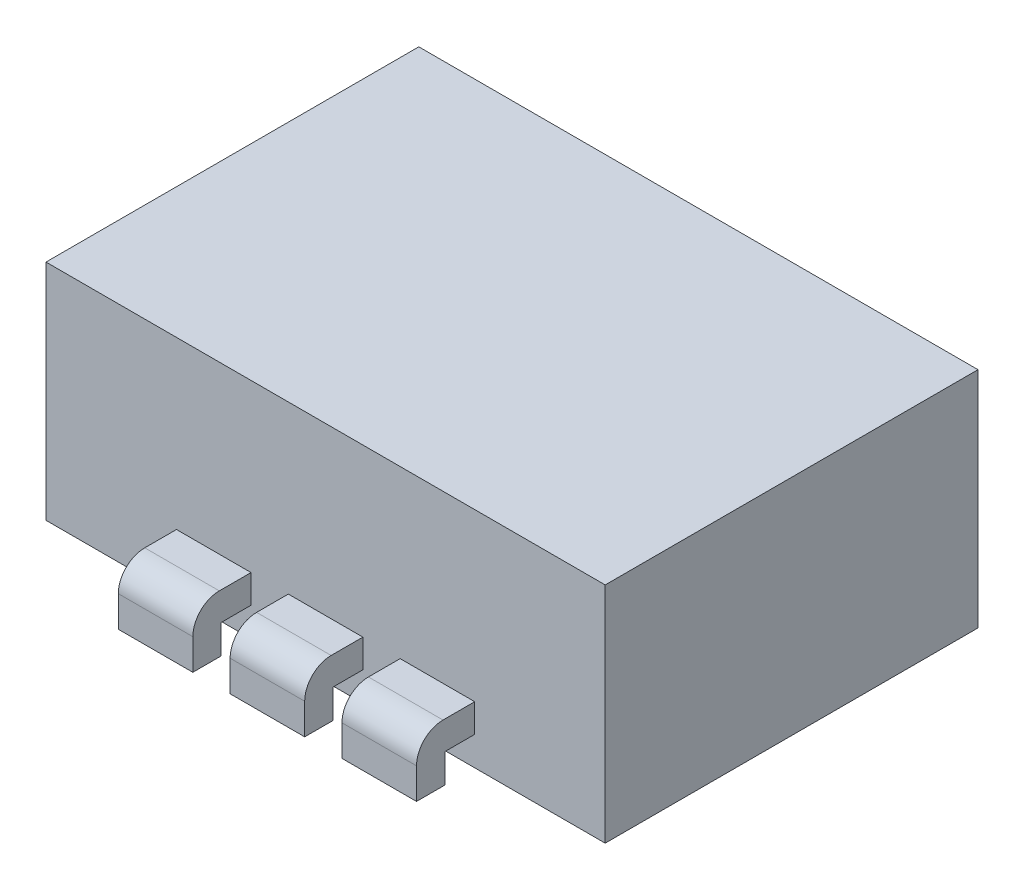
ISO-10303-21;
HEADER;
FILE_DESCRIPTION(('STEP AP214'),'2;1');
FILE_NAME('part.step','',(''),(''),'','','');
FILE_SCHEMA(('AUTOMOTIVE_DESIGN { 1 0 10303 214 1 1 1 1 }'));
ENDSEC;
DATA;
#1=APPLICATION_CONTEXT('core data for automotive mechanical design processes');
#2=APPLICATION_PROTOCOL_DEFINITION('international standard','automotive_design',2000,#1);
#3=PRODUCT_CONTEXT('',#1,'mechanical');
#4=PRODUCT('Part','Part','',(#3));
#5=PRODUCT_RELATED_PRODUCT_CATEGORY('part','',(#4));
#6=PRODUCT_DEFINITION_FORMATION('','',#4);
#7=PRODUCT_DEFINITION_CONTEXT('part definition',#1,'design');
#8=PRODUCT_DEFINITION('design','',#6,#7);
#9=PRODUCT_DEFINITION_SHAPE('','',#8);
#10=(LENGTH_UNIT() NAMED_UNIT(*) SI_UNIT(.MILLI.,.METRE.));
#11=(NAMED_UNIT(*) PLANE_ANGLE_UNIT() SI_UNIT($,.RADIAN.));
#12=(NAMED_UNIT(*) SI_UNIT($,.STERADIAN.) SOLID_ANGLE_UNIT());
#13=UNCERTAINTY_MEASURE_WITH_UNIT(LENGTH_MEASURE(1.E-05),#10,'distance_accuracy_value','');
#14=(GEOMETRIC_REPRESENTATION_CONTEXT(3) GLOBAL_UNCERTAINTY_ASSIGNED_CONTEXT((#13)) GLOBAL_UNIT_ASSIGNED_CONTEXT((#10,
#11,#12)) REPRESENTATION_CONTEXT('',''));
#15=CARTESIAN_POINT('',(0.,0.,0.));
#16=DIRECTION('',(0.,0.,1.));
#17=DIRECTION('',(1.,0.,0.));
#18=AXIS2_PLACEMENT_3D('',#15,#16,#17);
#19=CARTESIAN_POINT('',(0.3,0.0827325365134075,0.585140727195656));
#20=DIRECTION('',(1.,0.,0.));
#21=DIRECTION('',(0.,0.,-1.));
#22=AXIS2_PLACEMENT_3D('',#19,#20,#21);
#23=CYLINDRICAL_SURFACE('',#22,0.0709742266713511);
#24=DIRECTION('',(1.,0.,0.));
#25=VECTOR('',#24,1.);
#26=CARTESIAN_POINT('',(0.3,0.153706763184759,0.585140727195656));
#27=LINE('',#26,#25);
#28=CARTESIAN_POINT('',(0.2,0.153706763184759,0.585140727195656));
#29=VERTEX_POINT('',#28);
#30=CARTESIAN_POINT('',(0.4,0.153706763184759,0.585140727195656));
#31=VERTEX_POINT('',#30);
#32=EDGE_CURVE('E225',#29,#31,#27,.T.);
#33=ORIENTED_EDGE('',*,*,#32,.F.);
#34=CARTESIAN_POINT('',(0.2,0.0827325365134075,0.585140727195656));
#35=DIRECTION('',(1.,0.,0.));
#36=DIRECTION('',(0.,0.,-1.));
#37=AXIS2_PLACEMENT_3D('',#34,#35,#36);
#38=CIRCLE('',#37,0.0709742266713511);
#39=CARTESIAN_POINT('',(0.2,0.0827325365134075,0.656114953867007));
#40=VERTEX_POINT('',#39);
#41=EDGE_CURVE('E19',#29,#40,#38,.T.);
#42=ORIENTED_EDGE('',*,*,#41,.T.);
#43=DIRECTION('',(1.,0.,0.));
#44=VECTOR('',#43,1.);
#45=CARTESIAN_POINT('',(0.3,0.0827325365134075,0.656114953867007));
#46=LINE('',#45,#44);
#47=CARTESIAN_POINT('',(0.4,0.0827325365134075,0.656114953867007));
#48=VERTEX_POINT('',#47);
#49=EDGE_CURVE('E588',#48,#40,#46,.F.);
#50=ORIENTED_EDGE('',*,*,#49,.F.);
#51=CARTESIAN_POINT('',(0.4,0.0827325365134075,0.585140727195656));
#52=DIRECTION('',(1.,0.,0.));
#53=DIRECTION('',(0.,0.,-1.));
#54=AXIS2_PLACEMENT_3D('',#51,#52,#53);
#55=CIRCLE('',#54,0.0709742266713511);
#56=EDGE_CURVE('E659',#31,#48,#55,.T.);
#57=ORIENTED_EDGE('',*,*,#56,.F.);
#58=EDGE_LOOP('',(#33,#42,#50,#57));
#59=FACE_BOUND('',#58,.T.);
#60=ADVANCED_FACE('F15',(#59),#23,.T.);
#61=CARTESIAN_POINT('',(0.3,0.0827325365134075,0.656114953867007));
#62=DIRECTION('',(0.,0.,1.));
#63=DIRECTION('',(1.,0.,0.));
#64=AXIS2_PLACEMENT_3D('',#61,#62,#63);
#65=PLANE('',#64);
#66=ORIENTED_EDGE('',*,*,#49,.T.);
#67=DIRECTION('',(0.,1.,0.));
#68=VECTOR('',#67,1.);
#69=CARTESIAN_POINT('',(0.2,0.0806235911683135,0.656114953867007));
#70=LINE('',#69,#68);
#71=CARTESIAN_POINT('',(0.2,0.,0.656114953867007));
#72=VERTEX_POINT('',#71);
#73=EDGE_CURVE('E625',#40,#72,#70,.F.);
#74=ORIENTED_EDGE('',*,*,#73,.T.);
#75=DIRECTION('',(1.,0.,0.));
#76=VECTOR('',#75,1.);
#77=CARTESIAN_POINT('',(0.3,0.,0.656114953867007));
#78=LINE('',#77,#76);
#79=CARTESIAN_POINT('',(0.4,0.,0.656114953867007));
#80=VERTEX_POINT('',#79);
#81=EDGE_CURVE('E591',#80,#72,#78,.F.);
#82=ORIENTED_EDGE('',*,*,#81,.F.);
#83=DIRECTION('',(0.,1.,0.));
#84=VECTOR('',#83,1.);
#85=CARTESIAN_POINT('',(0.4,0.0806235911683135,0.656114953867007));
#86=LINE('',#85,#84);
#87=EDGE_CURVE('E596',#48,#80,#86,.F.);
#88=ORIENTED_EDGE('',*,*,#87,.F.);
#89=EDGE_LOOP('',(#66,#74,#82,#88));
#90=FACE_BOUND('',#89,.T.);
#91=ADVANCED_FACE('F987',(#90),#65,.T.);
#92=CARTESIAN_POINT('',(0.3,0.,0.656114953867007));
#93=DIRECTION('',(0.,-1.,0.));
#94=DIRECTION('',(0.,0.,-1.));
#95=AXIS2_PLACEMENT_3D('',#92,#93,#94);
#96=PLANE('',#95);
#97=ORIENTED_EDGE('',*,*,#81,.T.);
#98=DIRECTION('',(0.,0.,-1.));
#99=VECTOR('',#98,1.);
#100=CARTESIAN_POINT('',(0.2,0.,0.581702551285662));
#101=LINE('',#100,#99);
#102=CARTESIAN_POINT('',(0.2,0.,0.580189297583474));
#103=VERTEX_POINT('',#102);
#104=EDGE_CURVE('E233',#72,#103,#101,.T.);
#105=ORIENTED_EDGE('',*,*,#104,.T.);
#106=DIRECTION('',(1.,0.,0.));
#107=VECTOR('',#106,1.);
#108=CARTESIAN_POINT('',(0.3,0.,0.580189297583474));
#109=LINE('',#108,#107);
#110=CARTESIAN_POINT('',(0.4,0.,0.580189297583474));
#111=VERTEX_POINT('',#110);
#112=EDGE_CURVE('E546',#111,#103,#109,.F.);
#113=ORIENTED_EDGE('',*,*,#112,.F.);
#114=DIRECTION('',(0.,0.,-1.));
#115=VECTOR('',#114,1.);
#116=CARTESIAN_POINT('',(0.4,0.,0.581702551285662));
#117=LINE('',#116,#115);
#118=EDGE_CURVE('E592',#80,#111,#117,.T.);
#119=ORIENTED_EDGE('',*,*,#118,.F.);
#120=EDGE_LOOP('',(#97,#105,#113,#119));
#121=FACE_BOUND('',#120,.T.);
#122=ADVANCED_FACE('F983',(#121),#96,.T.);
#123=CARTESIAN_POINT('',(0.3,0.,0.580189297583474));
#124=DIRECTION('',(0.,2.09192452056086E-10,-1.));
#125=DIRECTION('',(0.,1.,2.09192452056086E-10));
#126=AXIS2_PLACEMENT_3D('',#123,#124,#125);
#127=PLANE('',#126);
#128=ORIENTED_EDGE('',*,*,#112,.T.);
#129=DIRECTION('',(0.,1.,0.));
#130=VECTOR('',#129,1.);
#131=CARTESIAN_POINT('',(0.2,0.0806235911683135,0.580189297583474));
#132=LINE('',#131,#130);
#133=CARTESIAN_POINT('',(0.2,0.0777811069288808,0.580189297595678));
#134=VERTEX_POINT('',#133);
#135=EDGE_CURVE('E604',#103,#134,#132,.T.);
#136=ORIENTED_EDGE('',*,*,#135,.T.);
#137=DIRECTION('',(1.,0.,0.));
#138=VECTOR('',#137,1.);
#139=CARTESIAN_POINT('',(0.3,0.0777811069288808,0.580189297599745));
#140=LINE('',#139,#138);
#141=CARTESIAN_POINT('',(0.4,0.0777811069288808,0.58018929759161));
#142=VERTEX_POINT('',#141);
#143=EDGE_CURVE('E674',#142,#134,#140,.F.);
#144=ORIENTED_EDGE('',*,*,#143,.F.);
#145=DIRECTION('',(0.,1.,0.));
#146=VECTOR('',#145,1.);
#147=CARTESIAN_POINT('',(0.4,0.0806235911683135,0.580189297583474));
#148=LINE('',#147,#146);
#149=EDGE_CURVE('E595',#111,#142,#148,.T.);
#150=ORIENTED_EDGE('',*,*,#149,.F.);
#151=EDGE_LOOP('',(#128,#136,#144,#150));
#152=FACE_BOUND('',#151,.T.);
#153=ADVANCED_FACE('F979',(#152),#127,.T.);
#154=CARTESIAN_POINT('',(-0.3,0.0827325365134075,0.585140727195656));
#155=DIRECTION('',(1.,0.,0.));
#156=DIRECTION('',(0.,0.,-1.));
#157=AXIS2_PLACEMENT_3D('',#154,#155,#156);
#158=CYLINDRICAL_SURFACE('',#157,0.0709742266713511);
#159=DIRECTION('',(1.,0.,0.));
#160=VECTOR('',#159,1.);
#161=CARTESIAN_POINT('',(-0.3,0.153706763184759,0.585140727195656));
#162=LINE('',#161,#160);
#163=CARTESIAN_POINT('',(-0.4,0.153706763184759,0.585140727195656));
#164=VERTEX_POINT('',#163);
#165=CARTESIAN_POINT('',(-0.2,0.153706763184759,0.585140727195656));
#166=VERTEX_POINT('',#165);
#167=EDGE_CURVE('E558',#164,#166,#162,.T.);
#168=ORIENTED_EDGE('',*,*,#167,.F.);
#169=CARTESIAN_POINT('',(-0.4,0.0827325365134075,0.585140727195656));
#170=DIRECTION('',(1.,0.,0.));
#171=DIRECTION('',(0.,0.,-1.));
#172=AXIS2_PLACEMENT_3D('',#169,#170,#171);
#173=CIRCLE('',#172,0.0709742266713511);
#174=CARTESIAN_POINT('',(-0.4,0.0827325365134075,0.656114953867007));
#175=VERTEX_POINT('',#174);
#176=EDGE_CURVE('E657',#164,#175,#173,.T.);
#177=ORIENTED_EDGE('',*,*,#176,.T.);
#178=DIRECTION('',(1.,0.,0.));
#179=VECTOR('',#178,1.);
#180=CARTESIAN_POINT('',(-0.3,0.0827325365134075,0.656114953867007));
#181=LINE('',#180,#179);
#182=CARTESIAN_POINT('',(-0.2,0.0827325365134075,0.656114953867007));
#183=VERTEX_POINT('',#182);
#184=EDGE_CURVE('E542',#183,#175,#181,.F.);
#185=ORIENTED_EDGE('',*,*,#184,.F.);
#186=CARTESIAN_POINT('',(-0.2,0.0827325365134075,0.585140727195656));
#187=DIRECTION('',(1.,0.,0.));
#188=DIRECTION('',(0.,0.,-1.));
#189=AXIS2_PLACEMENT_3D('',#186,#187,#188);
#190=CIRCLE('',#189,0.0709742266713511);
#191=EDGE_CURVE('E654',#166,#183,#190,.T.);
#192=ORIENTED_EDGE('',*,*,#191,.F.);
#193=EDGE_LOOP('',(#168,#177,#185,#192));
#194=FACE_BOUND('',#193,.T.);
#195=ADVANCED_FACE('F975',(#194),#158,.T.);
#196=CARTESIAN_POINT('',(-0.3,0.0827325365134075,0.656114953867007));
#197=DIRECTION('',(0.,0.,1.));
#198=DIRECTION('',(1.,0.,0.));
#199=AXIS2_PLACEMENT_3D('',#196,#197,#198);
#200=PLANE('',#199);
#201=ORIENTED_EDGE('',*,*,#184,.T.);
#202=DIRECTION('',(0.,1.,0.));
#203=VECTOR('',#202,1.);
#204=CARTESIAN_POINT('',(-0.4,0.0806235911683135,0.656114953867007));
#205=LINE('',#204,#203);
#206=CARTESIAN_POINT('',(-0.4,0.,0.656114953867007));
#207=VERTEX_POINT('',#206);
#208=EDGE_CURVE('E585',#175,#207,#205,.F.);
#209=ORIENTED_EDGE('',*,*,#208,.T.);
#210=DIRECTION('',(1.,0.,0.));
#211=VECTOR('',#210,1.);
#212=CARTESIAN_POINT('',(-0.3,0.,0.656114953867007));
#213=LINE('',#212,#211);
#214=CARTESIAN_POINT('',(-0.2,0.,0.656114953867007));
#215=VERTEX_POINT('',#214);
#216=EDGE_CURVE('E545',#215,#207,#213,.F.);
#217=ORIENTED_EDGE('',*,*,#216,.F.);
#218=DIRECTION('',(0.,1.,0.));
#219=VECTOR('',#218,1.);
#220=CARTESIAN_POINT('',(-0.2,0.0806235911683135,0.656114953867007));
#221=LINE('',#220,#219);
#222=EDGE_CURVE('E551',#183,#215,#221,.F.);
#223=ORIENTED_EDGE('',*,*,#222,.F.);
#224=EDGE_LOOP('',(#201,#209,#217,#223));
#225=FACE_BOUND('',#224,.T.);
#226=ADVANCED_FACE('F971',(#225),#200,.T.);
#227=CARTESIAN_POINT('',(-0.3,0.,0.656114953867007));
#228=DIRECTION('',(0.,-1.,0.));
#229=DIRECTION('',(0.,0.,-1.));
#230=AXIS2_PLACEMENT_3D('',#227,#228,#229);
#231=PLANE('',#230);
#232=ORIENTED_EDGE('',*,*,#216,.T.);
#233=DIRECTION('',(0.,0.,-1.));
#234=VECTOR('',#233,1.);
#235=CARTESIAN_POINT('',(-0.4,0.,0.581702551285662));
#236=LINE('',#235,#234);
#237=CARTESIAN_POINT('',(-0.4,0.,0.580189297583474));
#238=VERTEX_POINT('',#237);
#239=EDGE_CURVE('E583',#207,#238,#236,.T.);
#240=ORIENTED_EDGE('',*,*,#239,.T.);
#241=DIRECTION('',(1.,0.,0.));
#242=VECTOR('',#241,1.);
#243=CARTESIAN_POINT('',(-0.3,0.,0.580189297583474));
#244=LINE('',#243,#242);
#245=CARTESIAN_POINT('',(-0.2,0.,0.580189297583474));
#246=VERTEX_POINT('',#245);
#247=EDGE_CURVE('E499',#246,#238,#244,.F.);
#248=ORIENTED_EDGE('',*,*,#247,.F.);
#249=DIRECTION('',(0.,0.,-1.));
#250=VECTOR('',#249,1.);
#251=CARTESIAN_POINT('',(-0.2,0.,0.581702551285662));
#252=LINE('',#251,#250);
#253=EDGE_CURVE('E547',#215,#246,#252,.T.);
#254=ORIENTED_EDGE('',*,*,#253,.F.);
#255=EDGE_LOOP('',(#232,#240,#248,#254));
#256=FACE_BOUND('',#255,.T.);
#257=ADVANCED_FACE('F967',(#256),#231,.T.);
#258=CARTESIAN_POINT('',(-0.3,0.,0.580189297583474));
#259=DIRECTION('',(0.,2.09192452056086E-10,-1.));
#260=DIRECTION('',(0.,1.,2.09192452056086E-10));
#261=AXIS2_PLACEMENT_3D('',#258,#259,#260);
#262=PLANE('',#261);
#263=ORIENTED_EDGE('',*,*,#247,.T.);
#264=DIRECTION('',(0.,1.,0.));
#265=VECTOR('',#264,1.);
#266=CARTESIAN_POINT('',(-0.4,0.0806235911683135,0.580189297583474));
#267=LINE('',#266,#265);
#268=CARTESIAN_POINT('',(-0.4,0.0777811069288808,0.580189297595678));
#269=VERTEX_POINT('',#268);
#270=EDGE_CURVE('E561',#238,#269,#267,.T.);
#271=ORIENTED_EDGE('',*,*,#270,.T.);
#272=DIRECTION('',(1.,0.,0.));
#273=VECTOR('',#272,1.);
#274=CARTESIAN_POINT('',(-0.3,0.0777811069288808,0.580189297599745));
#275=LINE('',#274,#273);
#276=CARTESIAN_POINT('',(-0.2,0.0777811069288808,0.58018929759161));
#277=VERTEX_POINT('',#276);
#278=EDGE_CURVE('E696',#277,#269,#275,.F.);
#279=ORIENTED_EDGE('',*,*,#278,.F.);
#280=DIRECTION('',(0.,1.,0.));
#281=VECTOR('',#280,1.);
#282=CARTESIAN_POINT('',(-0.2,0.0806235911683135,0.580189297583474));
#283=LINE('',#282,#281);
#284=EDGE_CURVE('E550',#246,#277,#283,.T.);
#285=ORIENTED_EDGE('',*,*,#284,.F.);
#286=EDGE_LOOP('',(#263,#271,#279,#285));
#287=FACE_BOUND('',#286,.T.);
#288=ADVANCED_FACE('F963',(#287),#262,.T.);
#289=CARTESIAN_POINT('',(0.,0.0827325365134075,0.585140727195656));
#290=DIRECTION('',(1.,0.,0.));
#291=DIRECTION('',(0.,0.,-1.));
#292=AXIS2_PLACEMENT_3D('',#289,#290,#291);
#293=CYLINDRICAL_SURFACE('',#292,0.0709742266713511);
#294=DIRECTION('',(1.,0.,0.));
#295=VECTOR('',#294,1.);
#296=CARTESIAN_POINT('',(0.,0.153706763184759,0.585140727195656));
#297=LINE('',#296,#295);
#298=CARTESIAN_POINT('',(-0.1,0.153706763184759,0.585140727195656));
#299=VERTEX_POINT('',#298);
#300=CARTESIAN_POINT('',(0.1,0.153706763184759,0.585140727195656));
#301=VERTEX_POINT('',#300);
#302=EDGE_CURVE('E511',#299,#301,#297,.T.);
#303=ORIENTED_EDGE('',*,*,#302,.F.);
#304=CARTESIAN_POINT('',(-0.1,0.0827325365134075,0.585140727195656));
#305=DIRECTION('',(1.,0.,0.));
#306=DIRECTION('',(0.,0.,-1.));
#307=AXIS2_PLACEMENT_3D('',#304,#305,#306);
#308=CIRCLE('',#307,0.0709742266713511);
#309=CARTESIAN_POINT('',(-0.1,0.0827325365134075,0.656114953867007));
#310=VERTEX_POINT('',#309);
#311=EDGE_CURVE('E651',#299,#310,#308,.T.);
#312=ORIENTED_EDGE('',*,*,#311,.T.);
#313=DIRECTION('',(1.,0.,0.));
#314=VECTOR('',#313,1.);
#315=CARTESIAN_POINT('',(0.,0.0827325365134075,0.656114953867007));
#316=LINE('',#315,#314);
#317=CARTESIAN_POINT('',(0.1,0.0827325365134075,0.656114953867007));
#318=VERTEX_POINT('',#317);
#319=EDGE_CURVE('E495',#318,#310,#316,.F.);
#320=ORIENTED_EDGE('',*,*,#319,.F.);
#321=CARTESIAN_POINT('',(0.1,0.0827325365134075,0.585140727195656));
#322=DIRECTION('',(1.,0.,0.));
#323=DIRECTION('',(0.,0.,-1.));
#324=AXIS2_PLACEMENT_3D('',#321,#322,#323);
#325=CIRCLE('',#324,0.0709742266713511);
#326=EDGE_CURVE('E648',#301,#318,#325,.T.);
#327=ORIENTED_EDGE('',*,*,#326,.F.);
#328=EDGE_LOOP('',(#303,#312,#320,#327));
#329=FACE_BOUND('',#328,.T.);
#330=ADVANCED_FACE('F959',(#329),#293,.T.);
#331=CARTESIAN_POINT('',(0.,0.0827325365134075,0.656114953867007));
#332=DIRECTION('',(0.,0.,1.));
#333=DIRECTION('',(1.,0.,0.));
#334=AXIS2_PLACEMENT_3D('',#331,#332,#333);
#335=PLANE('',#334);
#336=ORIENTED_EDGE('',*,*,#319,.T.);
#337=DIRECTION('',(0.,1.,0.));
#338=VECTOR('',#337,1.);
#339=CARTESIAN_POINT('',(-0.1,0.0806235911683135,0.656114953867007));
#340=LINE('',#339,#338);
#341=CARTESIAN_POINT('',(-0.1,0.,0.656114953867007));
#342=VERTEX_POINT('',#341);
#343=EDGE_CURVE('E539',#310,#342,#340,.F.);
#344=ORIENTED_EDGE('',*,*,#343,.T.);
#345=DIRECTION('',(1.,0.,0.));
#346=VECTOR('',#345,1.);
#347=CARTESIAN_POINT('',(0.,0.,0.656114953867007));
#348=LINE('',#347,#346);
#349=CARTESIAN_POINT('',(0.1,0.,0.656114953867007));
#350=VERTEX_POINT('',#349);
#351=EDGE_CURVE('E498',#350,#342,#348,.F.);
#352=ORIENTED_EDGE('',*,*,#351,.F.);
#353=DIRECTION('',(0.,1.,0.));
#354=VECTOR('',#353,1.);
#355=CARTESIAN_POINT('',(0.1,0.0806235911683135,0.656114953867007));
#356=LINE('',#355,#354);
#357=EDGE_CURVE('E504',#318,#350,#356,.F.);
#358=ORIENTED_EDGE('',*,*,#357,.F.);
#359=EDGE_LOOP('',(#336,#344,#352,#358));
#360=FACE_BOUND('',#359,.T.);
#361=ADVANCED_FACE('F955',(#360),#335,.T.);
#362=CARTESIAN_POINT('',(0.,0.,0.656114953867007));
#363=DIRECTION('',(0.,-1.,0.));
#364=DIRECTION('',(0.,0.,-1.));
#365=AXIS2_PLACEMENT_3D('',#362,#363,#364);
#366=PLANE('',#365);
#367=ORIENTED_EDGE('',*,*,#351,.T.);
#368=DIRECTION('',(0.,0.,-1.));
#369=VECTOR('',#368,1.);
#370=CARTESIAN_POINT('',(-0.1,0.,0.581702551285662));
#371=LINE('',#370,#369);
#372=CARTESIAN_POINT('',(-0.1,0.,0.580189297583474));
#373=VERTEX_POINT('',#372);
#374=EDGE_CURVE('E537',#342,#373,#371,.T.);
#375=ORIENTED_EDGE('',*,*,#374,.T.);
#376=DIRECTION('',(1.,0.,0.));
#377=VECTOR('',#376,1.);
#378=CARTESIAN_POINT('',(0.,0.,0.580189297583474));
#379=LINE('',#378,#377);
#380=CARTESIAN_POINT('',(0.1,0.,0.580189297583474));
#381=VERTEX_POINT('',#380);
#382=EDGE_CURVE('E478',#381,#373,#379,.F.);
#383=ORIENTED_EDGE('',*,*,#382,.F.);
#384=DIRECTION('',(0.,0.,-1.));
#385=VECTOR('',#384,1.);
#386=CARTESIAN_POINT('',(0.1,0.,0.581702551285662));
#387=LINE('',#386,#385);
#388=EDGE_CURVE('E500',#350,#381,#387,.T.);
#389=ORIENTED_EDGE('',*,*,#388,.F.);
#390=EDGE_LOOP('',(#367,#375,#383,#389));
#391=FACE_BOUND('',#390,.T.);
#392=ADVANCED_FACE('F951',(#391),#366,.T.);
#393=CARTESIAN_POINT('',(0.,0.,0.580189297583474));
#394=DIRECTION('',(0.,2.09192452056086E-10,-1.));
#395=DIRECTION('',(0.,1.,2.09192452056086E-10));
#396=AXIS2_PLACEMENT_3D('',#393,#394,#395);
#397=PLANE('',#396);
#398=ORIENTED_EDGE('',*,*,#382,.T.);
#399=DIRECTION('',(0.,1.,0.));
#400=VECTOR('',#399,1.);
#401=CARTESIAN_POINT('',(-0.1,0.0806235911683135,0.580189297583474));
#402=LINE('',#401,#400);
#403=CARTESIAN_POINT('',(-0.1,0.0777811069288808,0.580189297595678));
#404=VERTEX_POINT('',#403);
#405=EDGE_CURVE('E514',#373,#404,#402,.T.);
#406=ORIENTED_EDGE('',*,*,#405,.T.);
#407=DIRECTION('',(1.,0.,0.));
#408=VECTOR('',#407,1.);
#409=CARTESIAN_POINT('',(0.,0.0777811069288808,0.580189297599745));
#410=LINE('',#409,#408);
#411=CARTESIAN_POINT('',(0.1,0.0777811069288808,0.58018929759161));
#412=VERTEX_POINT('',#411);
#413=EDGE_CURVE('E717',#412,#404,#410,.F.);
#414=ORIENTED_EDGE('',*,*,#413,.F.);
#415=DIRECTION('',(0.,1.,0.));
#416=VECTOR('',#415,1.);
#417=CARTESIAN_POINT('',(0.1,0.0806235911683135,0.580189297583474));
#418=LINE('',#417,#416);
#419=EDGE_CURVE('E503',#381,#412,#418,.T.);
#420=ORIENTED_EDGE('',*,*,#419,.F.);
#421=EDGE_LOOP('',(#398,#406,#414,#420));
#422=FACE_BOUND('',#421,.T.);
#423=ADVANCED_FACE('F947',(#422),#397,.T.);
#424=CARTESIAN_POINT('',(0.3,0.0827325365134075,-0.656114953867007));
#425=DIRECTION('',(0.,0.,1.));
#426=DIRECTION('',(1.,0.,0.));
#427=AXIS2_PLACEMENT_3D('',#424,#425,#426);
#428=PLANE('',#427);
#429=DIRECTION('',(0.,1.,0.));
#430=VECTOR('',#429,1.);
#431=CARTESIAN_POINT('',(0.2,0.0806235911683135,-0.656114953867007));
#432=LINE('',#431,#430);
#433=CARTESIAN_POINT('',(0.2,0.0827325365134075,-0.656114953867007));
#434=VERTEX_POINT('',#433);
#435=CARTESIAN_POINT('',(0.2,0.,-0.656114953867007));
#436=VERTEX_POINT('',#435);
#437=EDGE_CURVE('E492',#434,#436,#432,.F.);
#438=ORIENTED_EDGE('',*,*,#437,.F.);
#439=DIRECTION('',(-1.,0.,0.));
#440=VECTOR('',#439,1.);
#441=CARTESIAN_POINT('',(0.3,0.0827325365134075,-0.656114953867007));
#442=LINE('',#441,#440);
#443=CARTESIAN_POINT('',(0.4,0.0827325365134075,-0.656114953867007));
#444=VERTEX_POINT('',#443);
#445=EDGE_CURVE('E428',#444,#434,#442,.T.);
#446=ORIENTED_EDGE('',*,*,#445,.F.);
#447=DIRECTION('',(0.,1.,0.));
#448=VECTOR('',#447,1.);
#449=CARTESIAN_POINT('',(0.4,0.0806235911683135,-0.656114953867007));
#450=LINE('',#449,#448);
#451=CARTESIAN_POINT('',(0.4,0.,-0.656114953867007));
#452=VERTEX_POINT('',#451);
#453=EDGE_CURVE('E484',#444,#452,#450,.F.);
#454=ORIENTED_EDGE('',*,*,#453,.T.);
#455=DIRECTION('',(1.,0.,0.));
#456=VECTOR('',#455,1.);
#457=CARTESIAN_POINT('',(0.3,0.,-0.656114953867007));
#458=LINE('',#457,#456);
#459=EDGE_CURVE('E475',#452,#436,#458,.F.);
#460=ORIENTED_EDGE('',*,*,#459,.T.);
#461=EDGE_LOOP('',(#438,#446,#454,#460));
#462=FACE_BOUND('',#461,.T.);
#463=ADVANCED_FACE('F943',(#462),#428,.F.);
#464=CARTESIAN_POINT('',(0.3,0.,-0.656114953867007));
#465=DIRECTION('',(0.,1.,0.));
#466=DIRECTION('',(0.,0.,1.));
#467=AXIS2_PLACEMENT_3D('',#464,#465,#466);
#468=PLANE('',#467);
#469=DIRECTION('',(0.,0.,1.));
#470=VECTOR('',#469,1.);
#471=CARTESIAN_POINT('',(0.2,0.,-0.581702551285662));
#472=LINE('',#471,#470);
#473=CARTESIAN_POINT('',(0.2,0.,-0.580189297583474));
#474=VERTEX_POINT('',#473);
#475=EDGE_CURVE('E488',#436,#474,#472,.T.);
#476=ORIENTED_EDGE('',*,*,#475,.F.);
#477=ORIENTED_EDGE('',*,*,#459,.F.);
#478=DIRECTION('',(0.,0.,1.));
#479=VECTOR('',#478,1.);
#480=CARTESIAN_POINT('',(0.4,0.,-0.581702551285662));
#481=LINE('',#480,#479);
#482=CARTESIAN_POINT('',(0.4,0.,-0.580189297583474));
#483=VERTEX_POINT('',#482);
#484=EDGE_CURVE('E481',#452,#483,#481,.T.);
#485=ORIENTED_EDGE('',*,*,#484,.T.);
#486=DIRECTION('',(1.,0.,0.));
#487=VECTOR('',#486,1.);
#488=CARTESIAN_POINT('',(0.3,0.,-0.580189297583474));
#489=LINE('',#488,#487);
#490=EDGE_CURVE('E477',#483,#474,#489,.F.);
#491=ORIENTED_EDGE('',*,*,#490,.T.);
#492=EDGE_LOOP('',(#476,#477,#485,#491));
#493=FACE_BOUND('',#492,.T.);
#494=ADVANCED_FACE('F939',(#493),#468,.F.);
#495=CARTESIAN_POINT('',(0.3,0.,-0.580189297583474));
#496=DIRECTION('',(0.,-2.09192452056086E-10,-1.));
#497=DIRECTION('',(0.,1.,-2.09192452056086E-10));
#498=AXIS2_PLACEMENT_3D('',#495,#496,#497);
#499=PLANE('',#498);
#500=DIRECTION('',(0.,1.,0.));
#501=VECTOR('',#500,1.);
#502=CARTESIAN_POINT('',(0.2,0.0806235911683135,-0.580189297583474));
#503=LINE('',#502,#501);
#504=CARTESIAN_POINT('',(0.2,0.0777811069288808,-0.580189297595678));
#505=VERTEX_POINT('',#504);
#506=EDGE_CURVE('E491',#474,#505,#503,.T.);
#507=ORIENTED_EDGE('',*,*,#506,.F.);
#508=ORIENTED_EDGE('',*,*,#490,.F.);
#509=DIRECTION('',(0.,1.,0.));
#510=VECTOR('',#509,1.);
#511=CARTESIAN_POINT('',(0.4,0.0806235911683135,-0.580189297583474));
#512=LINE('',#511,#510);
#513=CARTESIAN_POINT('',(0.4,0.0777811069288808,-0.580189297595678));
#514=VERTEX_POINT('',#513);
#515=EDGE_CURVE('E483',#483,#514,#512,.T.);
#516=ORIENTED_EDGE('',*,*,#515,.T.);
#517=DIRECTION('',(1.,0.,0.));
#518=VECTOR('',#517,1.);
#519=CARTESIAN_POINT('',(0.3,0.0777811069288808,-0.580189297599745));
#520=LINE('',#519,#518);
#521=EDGE_CURVE('E724',#514,#505,#520,.F.);
#522=ORIENTED_EDGE('',*,*,#521,.T.);
#523=EDGE_LOOP('',(#507,#508,#516,#522));
#524=FACE_BOUND('',#523,.T.);
#525=ADVANCED_FACE('F935',(#524),#499,.F.);
#526=CARTESIAN_POINT('',(0.3,0.0827325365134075,-0.585140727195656));
#527=DIRECTION('',(-1.,0.,0.));
#528=DIRECTION('',(0.,0.,1.));
#529=AXIS2_PLACEMENT_3D('',#526,#527,#528);
#530=CYLINDRICAL_SURFACE('',#529,0.0709742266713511);
#531=DIRECTION('',(1.,0.,0.));
#532=VECTOR('',#531,1.);
#533=CARTESIAN_POINT('',(0.3,0.153706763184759,-0.585140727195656));
#534=LINE('',#533,#532);
#535=CARTESIAN_POINT('',(0.2,0.153706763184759,-0.585140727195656));
#536=VERTEX_POINT('',#535);
#537=CARTESIAN_POINT('',(0.4,0.153706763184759,-0.585140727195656));
#538=VERTEX_POINT('',#537);
#539=EDGE_CURVE('E448',#536,#538,#534,.T.);
#540=ORIENTED_EDGE('',*,*,#539,.T.);
#541=CARTESIAN_POINT('',(0.4,0.0827325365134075,-0.585140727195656));
#542=DIRECTION('',(-1.,0.,0.));
#543=DIRECTION('',(0.,0.,1.));
#544=AXIS2_PLACEMENT_3D('',#541,#542,#543);
#545=CIRCLE('',#544,0.0709742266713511);
#546=EDGE_CURVE('E640',#538,#444,#545,.T.);
#547=ORIENTED_EDGE('',*,*,#546,.T.);
#548=ORIENTED_EDGE('',*,*,#445,.T.);
#549=CARTESIAN_POINT('',(0.2,0.0827325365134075,-0.585140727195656));
#550=DIRECTION('',(-1.,0.,0.));
#551=DIRECTION('',(0.,0.,1.));
#552=AXIS2_PLACEMENT_3D('',#549,#550,#551);
#553=CIRCLE('',#552,0.0709742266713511);
#554=EDGE_CURVE('E644',#536,#434,#553,.T.);
#555=ORIENTED_EDGE('',*,*,#554,.F.);
#556=EDGE_LOOP('',(#540,#547,#548,#555));
#557=FACE_BOUND('',#556,.T.);
#558=ADVANCED_FACE('F931',(#557),#530,.T.);
#559=CARTESIAN_POINT('',(-0.3,0.0827325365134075,-0.656114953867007));
#560=DIRECTION('',(0.,0.,1.));
#561=DIRECTION('',(1.,0.,0.));
#562=AXIS2_PLACEMENT_3D('',#559,#560,#561);
#563=PLANE('',#562);
#564=DIRECTION('',(0.,1.,0.));
#565=VECTOR('',#564,1.);
#566=CARTESIAN_POINT('',(-0.4,0.0806235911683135,-0.656114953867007));
#567=LINE('',#566,#565);
#568=CARTESIAN_POINT('',(-0.4,0.0827325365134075,-0.656114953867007));
#569=VERTEX_POINT('',#568);
#570=CARTESIAN_POINT('',(-0.4,0.,-0.656114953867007));
#571=VERTEX_POINT('',#570);
#572=EDGE_CURVE('E442',#569,#571,#567,.F.);
#573=ORIENTED_EDGE('',*,*,#572,.F.);
#574=DIRECTION('',(-1.,0.,0.));
#575=VECTOR('',#574,1.);
#576=CARTESIAN_POINT('',(-0.3,0.0827325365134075,-0.656114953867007));
#577=LINE('',#576,#575);
#578=CARTESIAN_POINT('',(-0.2,0.0827325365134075,-0.656114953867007));
#579=VERTEX_POINT('',#578);
#580=EDGE_CURVE('E377',#579,#569,#577,.T.);
#581=ORIENTED_EDGE('',*,*,#580,.F.);
#582=DIRECTION('',(0.,1.,0.));
#583=VECTOR('',#582,1.);
#584=CARTESIAN_POINT('',(-0.2,0.0806235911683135,-0.656114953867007));
#585=LINE('',#584,#583);
#586=CARTESIAN_POINT('',(-0.2,0.,-0.656114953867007));
#587=VERTEX_POINT('',#586);
#588=EDGE_CURVE('E434',#579,#587,#585,.F.);
#589=ORIENTED_EDGE('',*,*,#588,.T.);
#590=DIRECTION('',(1.,0.,0.));
#591=VECTOR('',#590,1.);
#592=CARTESIAN_POINT('',(-0.3,0.,-0.656114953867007));
#593=LINE('',#592,#591);
#594=EDGE_CURVE('E425',#587,#571,#593,.F.);
#595=ORIENTED_EDGE('',*,*,#594,.T.);
#596=EDGE_LOOP('',(#573,#581,#589,#595));
#597=FACE_BOUND('',#596,.T.);
#598=ADVANCED_FACE('F927',(#597),#563,.F.);
#599=CARTESIAN_POINT('',(-0.3,0.,-0.656114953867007));
#600=DIRECTION('',(0.,1.,0.));
#601=DIRECTION('',(0.,0.,1.));
#602=AXIS2_PLACEMENT_3D('',#599,#600,#601);
#603=PLANE('',#602);
#604=DIRECTION('',(0.,0.,1.));
#605=VECTOR('',#604,1.);
#606=CARTESIAN_POINT('',(-0.4,0.,-0.581702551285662));
#607=LINE('',#606,#605);
#608=CARTESIAN_POINT('',(-0.4,0.,-0.580189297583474));
#609=VERTEX_POINT('',#608);
#610=EDGE_CURVE('E438',#571,#609,#607,.T.);
#611=ORIENTED_EDGE('',*,*,#610,.F.);
#612=ORIENTED_EDGE('',*,*,#594,.F.);
#613=DIRECTION('',(0.,0.,1.));
#614=VECTOR('',#613,1.);
#615=CARTESIAN_POINT('',(-0.2,0.,-0.581702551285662));
#616=LINE('',#615,#614);
#617=CARTESIAN_POINT('',(-0.2,0.,-0.580189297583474));
#618=VERTEX_POINT('',#617);
#619=EDGE_CURVE('E431',#587,#618,#616,.T.);
#620=ORIENTED_EDGE('',*,*,#619,.T.);
#621=DIRECTION('',(1.,0.,0.));
#622=VECTOR('',#621,1.);
#623=CARTESIAN_POINT('',(-0.3,0.,-0.580189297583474));
#624=LINE('',#623,#622);
#625=EDGE_CURVE('E427',#618,#609,#624,.F.);
#626=ORIENTED_EDGE('',*,*,#625,.T.);
#627=EDGE_LOOP('',(#611,#612,#620,#626));
#628=FACE_BOUND('',#627,.T.);
#629=ADVANCED_FACE('F923',(#628),#603,.F.);
#630=CARTESIAN_POINT('',(-0.3,0.,-0.580189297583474));
#631=DIRECTION('',(0.,-2.09192452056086E-10,-1.));
#632=DIRECTION('',(0.,1.,-2.09192452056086E-10));
#633=AXIS2_PLACEMENT_3D('',#630,#631,#632);
#634=PLANE('',#633);
#635=DIRECTION('',(0.,1.,0.));
#636=VECTOR('',#635,1.);
#637=CARTESIAN_POINT('',(-0.4,0.0806235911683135,-0.580189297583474));
#638=LINE('',#637,#636);
#639=CARTESIAN_POINT('',(-0.4,0.0777811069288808,-0.580189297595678));
#640=VERTEX_POINT('',#639);
#641=EDGE_CURVE('E441',#609,#640,#638,.T.);
#642=ORIENTED_EDGE('',*,*,#641,.F.);
#643=ORIENTED_EDGE('',*,*,#625,.F.);
#644=DIRECTION('',(0.,1.,0.));
#645=VECTOR('',#644,1.);
#646=CARTESIAN_POINT('',(-0.2,0.0806235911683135,-0.580189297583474));
#647=LINE('',#646,#645);
#648=CARTESIAN_POINT('',(-0.2,0.0777811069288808,-0.580189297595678));
#649=VERTEX_POINT('',#648);
#650=EDGE_CURVE('E433',#618,#649,#647,.T.);
#651=ORIENTED_EDGE('',*,*,#650,.T.);
#652=DIRECTION('',(1.,0.,0.));
#653=VECTOR('',#652,1.);
#654=CARTESIAN_POINT('',(-0.3,0.0777811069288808,-0.580189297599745));
#655=LINE('',#654,#653);
#656=EDGE_CURVE('E738',#649,#640,#655,.F.);
#657=ORIENTED_EDGE('',*,*,#656,.T.);
#658=EDGE_LOOP('',(#642,#643,#651,#657));
#659=FACE_BOUND('',#658,.T.);
#660=ADVANCED_FACE('F919',(#659),#634,.F.);
#661=CARTESIAN_POINT('',(-0.3,0.0827325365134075,-0.585140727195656));
#662=DIRECTION('',(-1.,0.,0.));
#663=DIRECTION('',(0.,0.,1.));
#664=AXIS2_PLACEMENT_3D('',#661,#662,#663);
#665=CYLINDRICAL_SURFACE('',#664,0.0709742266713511);
#666=DIRECTION('',(1.,0.,0.));
#667=VECTOR('',#666,1.);
#668=CARTESIAN_POINT('',(-0.3,0.153706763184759,-0.585140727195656));
#669=LINE('',#668,#667);
#670=CARTESIAN_POINT('',(-0.4,0.153706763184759,-0.585140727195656));
#671=VERTEX_POINT('',#670);
#672=CARTESIAN_POINT('',(-0.2,0.153706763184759,-0.585140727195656));
#673=VERTEX_POINT('',#672);
#674=EDGE_CURVE('E398',#671,#673,#669,.T.);
#675=ORIENTED_EDGE('',*,*,#674,.T.);
#676=CARTESIAN_POINT('',(-0.2,0.0827325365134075,-0.585140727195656));
#677=DIRECTION('',(-1.,0.,0.));
#678=DIRECTION('',(0.,0.,1.));
#679=AXIS2_PLACEMENT_3D('',#676,#677,#678);
#680=CIRCLE('',#679,0.0709742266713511);
#681=EDGE_CURVE('E634',#673,#579,#680,.T.);
#682=ORIENTED_EDGE('',*,*,#681,.T.);
#683=ORIENTED_EDGE('',*,*,#580,.T.);
#684=CARTESIAN_POINT('',(-0.4,0.0827325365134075,-0.585140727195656));
#685=DIRECTION('',(-1.,0.,0.));
#686=DIRECTION('',(0.,0.,1.));
#687=AXIS2_PLACEMENT_3D('',#684,#685,#686);
#688=CIRCLE('',#687,0.0709742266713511);
#689=EDGE_CURVE('E454',#671,#569,#688,.T.);
#690=ORIENTED_EDGE('',*,*,#689,.F.);
#691=EDGE_LOOP('',(#675,#682,#683,#690));
#692=FACE_BOUND('',#691,.T.);
#693=ADVANCED_FACE('F915',(#692),#665,.T.);
#694=CARTESIAN_POINT('',(0.,0.0827325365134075,-0.656114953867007));
#695=DIRECTION('',(0.,0.,1.));
#696=DIRECTION('',(1.,0.,0.));
#697=AXIS2_PLACEMENT_3D('',#694,#695,#696);
#698=PLANE('',#697);
#699=DIRECTION('',(0.,1.,0.));
#700=VECTOR('',#699,1.);
#701=CARTESIAN_POINT('',(-0.1,0.0806235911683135,-0.656114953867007));
#702=LINE('',#701,#700);
#703=CARTESIAN_POINT('',(-0.1,0.0827325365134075,-0.656114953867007));
#704=VERTEX_POINT('',#703);
#705=CARTESIAN_POINT('',(-0.1,0.,-0.656114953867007));
#706=VERTEX_POINT('',#705);
#707=EDGE_CURVE('E392',#704,#706,#702,.F.);
#708=ORIENTED_EDGE('',*,*,#707,.F.);
#709=DIRECTION('',(-1.,0.,0.));
#710=VECTOR('',#709,1.);
#711=CARTESIAN_POINT('',(0.,0.0827325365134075,-0.656114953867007));
#712=LINE('',#711,#710);
#713=CARTESIAN_POINT('',(0.1,0.0827325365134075,-0.656114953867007));
#714=VERTEX_POINT('',#713);
#715=EDGE_CURVE('E386',#714,#704,#712,.T.);
#716=ORIENTED_EDGE('',*,*,#715,.F.);
#717=DIRECTION('',(0.,1.,0.));
#718=VECTOR('',#717,1.);
#719=CARTESIAN_POINT('',(0.1,0.0806235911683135,-0.656114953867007));
#720=LINE('',#719,#718);
#721=CARTESIAN_POINT('',(0.1,0.,-0.656114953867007));
#722=VERTEX_POINT('',#721);
#723=EDGE_CURVE('E383',#714,#722,#720,.F.);
#724=ORIENTED_EDGE('',*,*,#723,.T.);
#725=DIRECTION('',(1.,0.,0.));
#726=VECTOR('',#725,1.);
#727=CARTESIAN_POINT('',(0.,0.,-0.656114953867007));
#728=LINE('',#727,#726);
#729=EDGE_CURVE('E374',#722,#706,#728,.F.);
#730=ORIENTED_EDGE('',*,*,#729,.T.);
#731=EDGE_LOOP('',(#708,#716,#724,#730));
#732=FACE_BOUND('',#731,.T.);
#733=ADVANCED_FACE('F911',(#732),#698,.F.);
#734=CARTESIAN_POINT('',(0.,0.,-0.656114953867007));
#735=DIRECTION('',(0.,1.,0.));
#736=DIRECTION('',(0.,0.,1.));
#737=AXIS2_PLACEMENT_3D('',#734,#735,#736);
#738=PLANE('',#737);
#739=DIRECTION('',(0.,0.,1.));
#740=VECTOR('',#739,1.);
#741=CARTESIAN_POINT('',(-0.1,0.,-0.581702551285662));
#742=LINE('',#741,#740);
#743=CARTESIAN_POINT('',(-0.1,0.,-0.580189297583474));
#744=VERTEX_POINT('',#743);
#745=EDGE_CURVE('E388',#706,#744,#742,.T.);
#746=ORIENTED_EDGE('',*,*,#745,.F.);
#747=ORIENTED_EDGE('',*,*,#729,.F.);
#748=DIRECTION('',(0.,0.,1.));
#749=VECTOR('',#748,1.);
#750=CARTESIAN_POINT('',(0.1,0.,-0.581702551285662));
#751=LINE('',#750,#749);
#752=CARTESIAN_POINT('',(0.1,0.,-0.580189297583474));
#753=VERTEX_POINT('',#752);
#754=EDGE_CURVE('E380',#722,#753,#751,.T.);
#755=ORIENTED_EDGE('',*,*,#754,.T.);
#756=DIRECTION('',(1.,0.,0.));
#757=VECTOR('',#756,1.);
#758=CARTESIAN_POINT('',(0.,0.,-0.580189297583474));
#759=LINE('',#758,#757);
#760=EDGE_CURVE('E376',#753,#744,#759,.F.);
#761=ORIENTED_EDGE('',*,*,#760,.T.);
#762=EDGE_LOOP('',(#746,#747,#755,#761));
#763=FACE_BOUND('',#762,.T.);
#764=ADVANCED_FACE('F907',(#763),#738,.F.);
#765=CARTESIAN_POINT('',(0.,0.,-0.580189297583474));
#766=DIRECTION('',(0.,-2.09192452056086E-10,-1.));
#767=DIRECTION('',(0.,1.,-2.09192452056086E-10));
#768=AXIS2_PLACEMENT_3D('',#765,#766,#767);
#769=PLANE('',#768);
#770=DIRECTION('',(0.,1.,0.));
#771=VECTOR('',#770,1.);
#772=CARTESIAN_POINT('',(-0.1,0.0806235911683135,-0.580189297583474));
#773=LINE('',#772,#771);
#774=CARTESIAN_POINT('',(-0.1,0.0777811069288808,-0.580189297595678));
#775=VERTEX_POINT('',#774);
#776=EDGE_CURVE('E391',#744,#775,#773,.T.);
#777=ORIENTED_EDGE('',*,*,#776,.F.);
#778=ORIENTED_EDGE('',*,*,#760,.F.);
#779=DIRECTION('',(0.,1.,0.));
#780=VECTOR('',#779,1.);
#781=CARTESIAN_POINT('',(0.1,0.0806235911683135,-0.580189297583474));
#782=LINE('',#781,#780);
#783=CARTESIAN_POINT('',(0.1,0.0777811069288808,-0.580189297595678));
#784=VERTEX_POINT('',#783);
#785=EDGE_CURVE('E382',#753,#784,#782,.T.);
#786=ORIENTED_EDGE('',*,*,#785,.T.);
#787=DIRECTION('',(1.,0.,0.));
#788=VECTOR('',#787,1.);
#789=CARTESIAN_POINT('',(0.,0.0777811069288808,-0.580189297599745));
#790=LINE('',#789,#788);
#791=EDGE_CURVE('E752',#784,#775,#790,.F.);
#792=ORIENTED_EDGE('',*,*,#791,.T.);
#793=EDGE_LOOP('',(#777,#778,#786,#792));
#794=FACE_BOUND('',#793,.T.);
#795=ADVANCED_FACE('F903',(#794),#769,.F.);
#796=CARTESIAN_POINT('',(0.,0.0827325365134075,-0.585140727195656));
#797=DIRECTION('',(-1.,0.,0.));
#798=DIRECTION('',(0.,0.,1.));
#799=AXIS2_PLACEMENT_3D('',#796,#797,#798);
#800=CYLINDRICAL_SURFACE('',#799,0.0709742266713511);
#801=DIRECTION('',(1.,0.,0.));
#802=VECTOR('',#801,1.);
#803=CARTESIAN_POINT('',(0.,0.153706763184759,-0.585140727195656));
#804=LINE('',#803,#802);
#805=CARTESIAN_POINT('',(-0.1,0.153706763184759,-0.585140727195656));
#806=VERTEX_POINT('',#805);
#807=CARTESIAN_POINT('',(0.1,0.153706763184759,-0.585140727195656));
#808=VERTEX_POINT('',#807);
#809=EDGE_CURVE('E326',#806,#808,#804,.T.);
#810=ORIENTED_EDGE('',*,*,#809,.T.);
#811=CARTESIAN_POINT('',(0.1,0.0827325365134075,-0.585140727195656));
#812=DIRECTION('',(-1.,0.,0.));
#813=DIRECTION('',(0.,0.,1.));
#814=AXIS2_PLACEMENT_3D('',#811,#812,#813);
#815=CIRCLE('',#814,0.0709742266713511);
#816=EDGE_CURVE('E628',#808,#714,#815,.T.);
#817=ORIENTED_EDGE('',*,*,#816,.T.);
#818=ORIENTED_EDGE('',*,*,#715,.T.);
#819=CARTESIAN_POINT('',(-0.1,0.0827325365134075,-0.585140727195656));
#820=DIRECTION('',(-1.,0.,0.));
#821=DIRECTION('',(0.,0.,1.));
#822=AXIS2_PLACEMENT_3D('',#819,#820,#821);
#823=CIRCLE('',#822,0.0709742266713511);
#824=EDGE_CURVE('E404',#806,#704,#823,.T.);
#825=ORIENTED_EDGE('',*,*,#824,.F.);
#826=EDGE_LOOP('',(#810,#817,#818,#825));
#827=FACE_BOUND('',#826,.T.);
#828=ADVANCED_FACE('F899',(#827),#800,.T.);
#829=CARTESIAN_POINT('',(0.2,0.0806235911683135,0.581702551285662));
#830=DIRECTION('',(1.,0.,0.));
#831=DIRECTION('',(0.,0.,-1.));
#832=AXIS2_PLACEMENT_3D('',#829,#830,#831);
#833=PLANE('',#832);
#834=DIRECTION('',(0.,1.,0.));
#835=VECTOR('',#834,1.);
#836=CARTESIAN_POINT('',(0.2,0.,0.5));
#837=LINE('',#836,#835);
#838=CARTESIAN_POINT('',(0.2,0.0777811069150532,0.5));
#839=VERTEX_POINT('',#838);
#840=CARTESIAN_POINT('',(0.2,0.153706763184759,0.5));
#841=VERTEX_POINT('',#840);
#842=EDGE_CURVE('E325',#839,#841,#837,.T.);
#843=ORIENTED_EDGE('',*,*,#842,.F.);
#844=DIRECTION('',(0.,-3.44873792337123E-10,-1.));
#845=VECTOR('',#844,1.);
#846=CARTESIAN_POINT('',(0.2,0.0777811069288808,0.580189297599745));
#847=LINE('',#846,#845);
#848=EDGE_CURVE('E658',#134,#839,#847,.T.);
#849=ORIENTED_EDGE('',*,*,#848,.F.);
#850=ORIENTED_EDGE('',*,*,#135,.F.);
#851=ORIENTED_EDGE('',*,*,#104,.F.);
#852=ORIENTED_EDGE('',*,*,#73,.F.);
#853=ORIENTED_EDGE('',*,*,#41,.F.);
#854=DIRECTION('',(0.,0.,1.));
#855=VECTOR('',#854,1.);
#856=CARTESIAN_POINT('',(0.2,0.153706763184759,0.5));
#857=LINE('',#856,#855);
#858=EDGE_CURVE('E603',#841,#29,#857,.T.);
#859=ORIENTED_EDGE('',*,*,#858,.F.);
#860=EDGE_LOOP('',(#843,#849,#850,#851,#852,#853,#859));
#861=FACE_BOUND('',#860,.T.);
#862=ADVANCED_FACE('F895',(#861),#833,.F.);
#863=CARTESIAN_POINT('',(0.3,0.153706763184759,0.5));
#864=DIRECTION('',(0.,1.,0.));
#865=DIRECTION('',(0.,0.,1.));
#866=AXIS2_PLACEMENT_3D('',#863,#864,#865);
#867=PLANE('',#866);
#868=DIRECTION('',(1.,0.,0.));
#869=VECTOR('',#868,1.);
#870=CARTESIAN_POINT('',(-0.75,0.153706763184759,0.5));
#871=LINE('',#870,#869);
#872=CARTESIAN_POINT('',(0.4,0.153706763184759,0.5));
#873=VERTEX_POINT('',#872);
#874=EDGE_CURVE('E608',#841,#873,#871,.T.);
#875=ORIENTED_EDGE('',*,*,#874,.F.);
#876=ORIENTED_EDGE('',*,*,#858,.T.);
#877=ORIENTED_EDGE('',*,*,#32,.T.);
#878=DIRECTION('',(0.,0.,-1.));
#879=VECTOR('',#878,1.);
#880=CARTESIAN_POINT('',(0.4,0.153706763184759,0.581702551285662));
#881=LINE('',#880,#879);
#882=EDGE_CURVE('E617',#873,#31,#881,.F.);
#883=ORIENTED_EDGE('',*,*,#882,.F.);
#884=EDGE_LOOP('',(#875,#876,#877,#883));
#885=FACE_BOUND('',#884,.T.);
#886=ADVANCED_FACE('F892',(#885),#867,.T.);
#887=CARTESIAN_POINT('',(0.4,0.0806235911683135,0.581702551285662));
#888=DIRECTION('',(1.,0.,0.));
#889=DIRECTION('',(0.,0.,-1.));
#890=AXIS2_PLACEMENT_3D('',#887,#888,#889);
#891=PLANE('',#890);
#892=DIRECTION('',(0.,-3.44873792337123E-10,-1.));
#893=VECTOR('',#892,1.);
#894=CARTESIAN_POINT('',(0.4,0.0777811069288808,0.580189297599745));
#895=LINE('',#894,#893);
#896=CARTESIAN_POINT('',(0.4,0.0777811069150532,0.5));
#897=VERTEX_POINT('',#896);
#898=EDGE_CURVE('E677',#897,#142,#895,.F.);
#899=ORIENTED_EDGE('',*,*,#898,.F.);
#900=DIRECTION('',(0.,1.,0.));
#901=VECTOR('',#900,1.);
#902=CARTESIAN_POINT('',(0.4,0.,0.5));
#903=LINE('',#902,#901);
#904=EDGE_CURVE('E605',#873,#897,#903,.F.);
#905=ORIENTED_EDGE('',*,*,#904,.F.);
#906=ORIENTED_EDGE('',*,*,#882,.T.);
#907=ORIENTED_EDGE('',*,*,#56,.T.);
#908=ORIENTED_EDGE('',*,*,#87,.T.);
#909=ORIENTED_EDGE('',*,*,#118,.T.);
#910=ORIENTED_EDGE('',*,*,#149,.T.);
#911=EDGE_LOOP('',(#899,#905,#906,#907,#908,#909,#910));
#912=FACE_BOUND('',#911,.T.);
#913=ADVANCED_FACE('F888',(#912),#891,.T.);
#914=CARTESIAN_POINT('',(0.3,0.0777811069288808,0.580189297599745));
#915=DIRECTION('',(0.,-1.,3.44873792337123E-10));
#916=DIRECTION('',(0.,-3.44873792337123E-10,-1.));
#917=AXIS2_PLACEMENT_3D('',#914,#915,#916);
#918=PLANE('',#917);
#919=ORIENTED_EDGE('',*,*,#143,.T.);
#920=ORIENTED_EDGE('',*,*,#848,.T.);
#921=DIRECTION('',(1.,0.,0.));
#922=VECTOR('',#921,1.);
#923=CARTESIAN_POINT('',(-0.75,0.0777811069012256,0.5));
#924=LINE('',#923,#922);
#925=EDGE_CURVE('E580',#897,#839,#924,.F.);
#926=ORIENTED_EDGE('',*,*,#925,.F.);
#927=ORIENTED_EDGE('',*,*,#898,.T.);
#928=EDGE_LOOP('',(#919,#920,#926,#927));
#929=FACE_BOUND('',#928,.T.);
#930=ADVANCED_FACE('F884',(#929),#918,.T.);
#931=CARTESIAN_POINT('',(-0.4,0.0806235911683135,0.581702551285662));
#932=DIRECTION('',(1.,0.,0.));
#933=DIRECTION('',(0.,0.,-1.));
#934=AXIS2_PLACEMENT_3D('',#931,#932,#933);
#935=PLANE('',#934);
#936=DIRECTION('',(0.,1.,0.));
#937=VECTOR('',#936,1.);
#938=CARTESIAN_POINT('',(-0.4,0.,0.5));
#939=LINE('',#938,#937);
#940=CARTESIAN_POINT('',(-0.4,0.0777811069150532,0.5));
#941=VERTEX_POINT('',#940);
#942=CARTESIAN_POINT('',(-0.4,0.153706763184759,0.5));
#943=VERTEX_POINT('',#942);
#944=EDGE_CURVE('E570',#941,#943,#939,.T.);
#945=ORIENTED_EDGE('',*,*,#944,.F.);
#946=DIRECTION('',(0.,-3.44873792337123E-10,-1.));
#947=VECTOR('',#946,1.);
#948=CARTESIAN_POINT('',(-0.4,0.0777811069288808,0.580189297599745));
#949=LINE('',#948,#947);
#950=EDGE_CURVE('E653',#269,#941,#949,.T.);
#951=ORIENTED_EDGE('',*,*,#950,.F.);
#952=ORIENTED_EDGE('',*,*,#270,.F.);
#953=ORIENTED_EDGE('',*,*,#239,.F.);
#954=ORIENTED_EDGE('',*,*,#208,.F.);
#955=ORIENTED_EDGE('',*,*,#176,.F.);
#956=DIRECTION('',(0.,0.,1.));
#957=VECTOR('',#956,1.);
#958=CARTESIAN_POINT('',(-0.4,0.153706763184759,0.5));
#959=LINE('',#958,#957);
#960=EDGE_CURVE('E560',#943,#164,#959,.T.);
#961=ORIENTED_EDGE('',*,*,#960,.F.);
#962=EDGE_LOOP('',(#945,#951,#952,#953,#954,#955,#961));
#963=FACE_BOUND('',#962,.T.);
#964=ADVANCED_FACE('F880',(#963),#935,.F.);
#965=CARTESIAN_POINT('',(-0.3,0.153706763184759,0.5));
#966=DIRECTION('',(0.,1.,0.));
#967=DIRECTION('',(0.,0.,1.));
#968=AXIS2_PLACEMENT_3D('',#965,#966,#967);
#969=PLANE('',#968);
#970=DIRECTION('',(1.,0.,0.));
#971=VECTOR('',#970,1.);
#972=CARTESIAN_POINT('',(-0.75,0.153706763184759,0.5));
#973=LINE('',#972,#971);
#974=CARTESIAN_POINT('',(-0.2,0.153706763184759,0.5));
#975=VERTEX_POINT('',#974);
#976=EDGE_CURVE('E565',#943,#975,#973,.T.);
#977=ORIENTED_EDGE('',*,*,#976,.F.);
#978=ORIENTED_EDGE('',*,*,#960,.T.);
#979=ORIENTED_EDGE('',*,*,#167,.T.);
#980=DIRECTION('',(0.,0.,-1.));
#981=VECTOR('',#980,1.);
#982=CARTESIAN_POINT('',(-0.2,0.153706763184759,0.581702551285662));
#983=LINE('',#982,#981);
#984=EDGE_CURVE('E575',#975,#166,#983,.F.);
#985=ORIENTED_EDGE('',*,*,#984,.F.);
#986=EDGE_LOOP('',(#977,#978,#979,#985));
#987=FACE_BOUND('',#986,.T.);
#988=ADVANCED_FACE('F876',(#987),#969,.T.);
#989=CARTESIAN_POINT('',(-0.2,0.0806235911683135,0.581702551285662));
#990=DIRECTION('',(1.,0.,0.));
#991=DIRECTION('',(0.,0.,-1.));
#992=AXIS2_PLACEMENT_3D('',#989,#990,#991);
#993=PLANE('',#992);
#994=DIRECTION('',(0.,-3.44873792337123E-10,-1.));
#995=VECTOR('',#994,1.);
#996=CARTESIAN_POINT('',(-0.2,0.0777811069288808,0.580189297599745));
#997=LINE('',#996,#995);
#998=CARTESIAN_POINT('',(-0.2,0.0777811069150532,0.5));
#999=VERTEX_POINT('',#998);
#1000=EDGE_CURVE('E685',#999,#277,#997,.F.);
#1001=ORIENTED_EDGE('',*,*,#1000,.F.);
#1002=DIRECTION('',(0.,1.,0.));
#1003=VECTOR('',#1002,1.);
#1004=CARTESIAN_POINT('',(-0.2,0.,0.5));
#1005=LINE('',#1004,#1003);
#1006=EDGE_CURVE('E562',#975,#999,#1005,.F.);
#1007=ORIENTED_EDGE('',*,*,#1006,.F.);
#1008=ORIENTED_EDGE('',*,*,#984,.T.);
#1009=ORIENTED_EDGE('',*,*,#191,.T.);
#1010=ORIENTED_EDGE('',*,*,#222,.T.);
#1011=ORIENTED_EDGE('',*,*,#253,.T.);
#1012=ORIENTED_EDGE('',*,*,#284,.T.);
#1013=EDGE_LOOP('',(#1001,#1007,#1008,#1009,#1010,#1011,#1012));
#1014=FACE_BOUND('',#1013,.T.);
#1015=ADVANCED_FACE('F872',(#1014),#993,.T.);
#1016=CARTESIAN_POINT('',(-0.3,0.0777811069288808,0.580189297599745));
#1017=DIRECTION('',(0.,-1.,3.44873792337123E-10));
#1018=DIRECTION('',(0.,-3.44873792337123E-10,-1.));
#1019=AXIS2_PLACEMENT_3D('',#1016,#1017,#1018);
#1020=PLANE('',#1019);
#1021=ORIENTED_EDGE('',*,*,#278,.T.);
#1022=ORIENTED_EDGE('',*,*,#950,.T.);
#1023=DIRECTION('',(1.,0.,0.));
#1024=VECTOR('',#1023,1.);
#1025=CARTESIAN_POINT('',(-0.75,0.0777811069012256,0.5));
#1026=LINE('',#1025,#1024);
#1027=EDGE_CURVE('E534',#999,#941,#1026,.F.);
#1028=ORIENTED_EDGE('',*,*,#1027,.F.);
#1029=ORIENTED_EDGE('',*,*,#1000,.T.);
#1030=EDGE_LOOP('',(#1021,#1022,#1028,#1029));
#1031=FACE_BOUND('',#1030,.T.);
#1032=ADVANCED_FACE('F868',(#1031),#1020,.T.);
#1033=CARTESIAN_POINT('',(-0.1,0.0806235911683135,0.581702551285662));
#1034=DIRECTION('',(1.,0.,0.));
#1035=DIRECTION('',(0.,0.,-1.));
#1036=AXIS2_PLACEMENT_3D('',#1033,#1034,#1035);
#1037=PLANE('',#1036);
#1038=DIRECTION('',(0.,1.,0.));
#1039=VECTOR('',#1038,1.);
#1040=CARTESIAN_POINT('',(-0.1,0.,0.5));
#1041=LINE('',#1040,#1039);
#1042=CARTESIAN_POINT('',(-0.1,0.0777811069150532,0.5));
#1043=VERTEX_POINT('',#1042);
#1044=CARTESIAN_POINT('',(-0.1,0.153706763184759,0.5));
#1045=VERTEX_POINT('',#1044);
#1046=EDGE_CURVE('E524',#1043,#1045,#1041,.T.);
#1047=ORIENTED_EDGE('',*,*,#1046,.F.);
#1048=DIRECTION('',(0.,-3.44873792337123E-10,-1.));
#1049=VECTOR('',#1048,1.);
#1050=CARTESIAN_POINT('',(-0.1,0.0777811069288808,0.580189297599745));
#1051=LINE('',#1050,#1049);
#1052=EDGE_CURVE('E647',#404,#1043,#1051,.T.);
#1053=ORIENTED_EDGE('',*,*,#1052,.F.);
#1054=ORIENTED_EDGE('',*,*,#405,.F.);
#1055=ORIENTED_EDGE('',*,*,#374,.F.);
#1056=ORIENTED_EDGE('',*,*,#343,.F.);
#1057=ORIENTED_EDGE('',*,*,#311,.F.);
#1058=DIRECTION('',(0.,0.,1.));
#1059=VECTOR('',#1058,1.);
#1060=CARTESIAN_POINT('',(-0.1,0.153706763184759,0.5));
#1061=LINE('',#1060,#1059);
#1062=EDGE_CURVE('E513',#1045,#299,#1061,.T.);
#1063=ORIENTED_EDGE('',*,*,#1062,.F.);
#1064=EDGE_LOOP('',(#1047,#1053,#1054,#1055,#1056,#1057,#1063));
#1065=FACE_BOUND('',#1064,.T.);
#1066=ADVANCED_FACE('F864',(#1065),#1037,.F.);
#1067=CARTESIAN_POINT('',(0.,0.153706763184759,0.5));
#1068=DIRECTION('',(0.,1.,0.));
#1069=DIRECTION('',(0.,0.,1.));
#1070=AXIS2_PLACEMENT_3D('',#1067,#1068,#1069);
#1071=PLANE('',#1070);
#1072=DIRECTION('',(1.,0.,0.));
#1073=VECTOR('',#1072,1.);
#1074=CARTESIAN_POINT('',(-0.75,0.153706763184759,0.5));
#1075=LINE('',#1074,#1073);
#1076=CARTESIAN_POINT('',(0.1,0.153706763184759,0.5));
#1077=VERTEX_POINT('',#1076);
#1078=EDGE_CURVE('E519',#1045,#1077,#1075,.T.);
#1079=ORIENTED_EDGE('',*,*,#1078,.F.);
#1080=ORIENTED_EDGE('',*,*,#1062,.T.);
#1081=ORIENTED_EDGE('',*,*,#302,.T.);
#1082=DIRECTION('',(0.,0.,-1.));
#1083=VECTOR('',#1082,1.);
#1084=CARTESIAN_POINT('',(0.1,0.153706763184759,0.581702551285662));
#1085=LINE('',#1084,#1083);
#1086=EDGE_CURVE('E529',#1077,#301,#1085,.F.);
#1087=ORIENTED_EDGE('',*,*,#1086,.F.);
#1088=EDGE_LOOP('',(#1079,#1080,#1081,#1087));
#1089=FACE_BOUND('',#1088,.T.);
#1090=ADVANCED_FACE('F860',(#1089),#1071,.T.);
#1091=CARTESIAN_POINT('',(0.1,0.0806235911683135,0.581702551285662));
#1092=DIRECTION('',(1.,0.,0.));
#1093=DIRECTION('',(0.,0.,-1.));
#1094=AXIS2_PLACEMENT_3D('',#1091,#1092,#1093);
#1095=PLANE('',#1094);
#1096=DIRECTION('',(0.,-3.44873792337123E-10,-1.));
#1097=VECTOR('',#1096,1.);
#1098=CARTESIAN_POINT('',(0.1,0.0777811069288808,0.580189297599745));
#1099=LINE('',#1098,#1097);
#1100=CARTESIAN_POINT('',(0.1,0.0777811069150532,0.5));
#1101=VERTEX_POINT('',#1100);
#1102=EDGE_CURVE('E706',#1101,#412,#1099,.F.);
#1103=ORIENTED_EDGE('',*,*,#1102,.F.);
#1104=DIRECTION('',(0.,1.,0.));
#1105=VECTOR('',#1104,1.);
#1106=CARTESIAN_POINT('',(0.1,0.,0.5));
#1107=LINE('',#1106,#1105);
#1108=EDGE_CURVE('E515',#1077,#1101,#1107,.F.);
#1109=ORIENTED_EDGE('',*,*,#1108,.F.);
#1110=ORIENTED_EDGE('',*,*,#1086,.T.);
#1111=ORIENTED_EDGE('',*,*,#326,.T.);
#1112=ORIENTED_EDGE('',*,*,#357,.T.);
#1113=ORIENTED_EDGE('',*,*,#388,.T.);
#1114=ORIENTED_EDGE('',*,*,#419,.T.);
#1115=EDGE_LOOP('',(#1103,#1109,#1110,#1111,#1112,#1113,#1114));
#1116=FACE_BOUND('',#1115,.T.);
#1117=ADVANCED_FACE('F856',(#1116),#1095,.T.);
#1118=CARTESIAN_POINT('',(0.,0.0777811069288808,0.580189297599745));
#1119=DIRECTION('',(0.,-1.,3.44873792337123E-10));
#1120=DIRECTION('',(0.,-3.44873792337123E-10,-1.));
#1121=AXIS2_PLACEMENT_3D('',#1118,#1119,#1120);
#1122=PLANE('',#1121);
#1123=ORIENTED_EDGE('',*,*,#413,.T.);
#1124=ORIENTED_EDGE('',*,*,#1052,.T.);
#1125=DIRECTION('',(1.,0.,0.));
#1126=VECTOR('',#1125,1.);
#1127=CARTESIAN_POINT('',(-0.75,0.0777811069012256,0.5));
#1128=LINE('',#1127,#1126);
#1129=EDGE_CURVE('E518',#1101,#1043,#1128,.F.);
#1130=ORIENTED_EDGE('',*,*,#1129,.F.);
#1131=ORIENTED_EDGE('',*,*,#1102,.T.);
#1132=EDGE_LOOP('',(#1123,#1124,#1130,#1131));
#1133=FACE_BOUND('',#1132,.T.);
#1134=ADVANCED_FACE('F852',(#1133),#1122,.T.);
#1135=CARTESIAN_POINT('',(0.2,0.0806235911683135,-0.581702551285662));
#1136=DIRECTION('',(-1.,0.,0.));
#1137=DIRECTION('',(0.,0.,1.));
#1138=AXIS2_PLACEMENT_3D('',#1135,#1136,#1137);
#1139=PLANE('',#1138);
#1140=DIRECTION('',(0.,-3.44873792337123E-10,1.));
#1141=VECTOR('',#1140,1.);
#1142=CARTESIAN_POINT('',(0.2,0.0777811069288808,-0.580189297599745));
#1143=LINE('',#1142,#1141);
#1144=CARTESIAN_POINT('',(0.2,0.0777811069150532,-0.5));
#1145=VERTEX_POINT('',#1144);
#1146=EDGE_CURVE('E643',#505,#1145,#1143,.T.);
#1147=ORIENTED_EDGE('',*,*,#1146,.T.);
#1148=DIRECTION('',(0.,1.,0.));
#1149=VECTOR('',#1148,1.);
#1150=CARTESIAN_POINT('',(0.2,0.,-0.5));
#1151=LINE('',#1150,#1149);
#1152=CARTESIAN_POINT('',(0.2,0.153706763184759,-0.5));
#1153=VERTEX_POINT('',#1152);
#1154=EDGE_CURVE('E455',#1153,#1145,#1151,.F.);
#1155=ORIENTED_EDGE('',*,*,#1154,.F.);
#1156=DIRECTION('',(0.,0.,-1.));
#1157=VECTOR('',#1156,1.);
#1158=CARTESIAN_POINT('',(0.2,0.153706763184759,-0.5));
#1159=LINE('',#1158,#1157);
#1160=EDGE_CURVE('E445',#1153,#536,#1159,.T.);
#1161=ORIENTED_EDGE('',*,*,#1160,.T.);
#1162=ORIENTED_EDGE('',*,*,#554,.T.);
#1163=ORIENTED_EDGE('',*,*,#437,.T.);
#1164=ORIENTED_EDGE('',*,*,#475,.T.);
#1165=ORIENTED_EDGE('',*,*,#506,.T.);
#1166=EDGE_LOOP('',(#1147,#1155,#1161,#1162,#1163,#1164,#1165));
#1167=FACE_BOUND('',#1166,.T.);
#1168=ADVANCED_FACE('F848',(#1167),#1139,.T.);
#1169=CARTESIAN_POINT('',(0.3,0.0777811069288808,-0.580189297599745));
#1170=DIRECTION('',(0.,1.,3.44873792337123E-10));
#1171=DIRECTION('',(0.,-3.44873792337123E-10,1.));
#1172=AXIS2_PLACEMENT_3D('',#1169,#1170,#1171);
#1173=PLANE('',#1172);
#1174=ORIENTED_EDGE('',*,*,#1146,.F.);
#1175=ORIENTED_EDGE('',*,*,#521,.F.);
#1176=DIRECTION('',(0.,0.,1.));
#1177=VECTOR('',#1176,1.);
#1178=CARTESIAN_POINT('',(0.4,0.0777811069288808,-0.581702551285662));
#1179=LINE('',#1178,#1177);
#1180=CARTESIAN_POINT('',(0.4,0.0777811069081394,-0.5));
#1181=VERTEX_POINT('',#1180);
#1182=EDGE_CURVE('E468',#514,#1181,#1179,.T.);
#1183=ORIENTED_EDGE('',*,*,#1182,.T.);
#1184=DIRECTION('',(-1.,0.,0.));
#1185=VECTOR('',#1184,1.);
#1186=CARTESIAN_POINT('',(0.75,0.0777811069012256,-0.5));
#1187=LINE('',#1186,#1185);
#1188=EDGE_CURVE('E458',#1145,#1181,#1187,.F.);
#1189=ORIENTED_EDGE('',*,*,#1188,.F.);
#1190=EDGE_LOOP('',(#1174,#1175,#1183,#1189));
#1191=FACE_BOUND('',#1190,.T.);
#1192=ADVANCED_FACE('F844',(#1191),#1173,.F.);
#1193=CARTESIAN_POINT('',(0.4,0.0806235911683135,-0.581702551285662));
#1194=DIRECTION('',(-1.,0.,0.));
#1195=DIRECTION('',(0.,0.,1.));
#1196=AXIS2_PLACEMENT_3D('',#1193,#1194,#1195);
#1197=PLANE('',#1196);
#1198=DIRECTION('',(0.,1.,0.));
#1199=VECTOR('',#1198,1.);
#1200=CARTESIAN_POINT('',(0.4,0.,-0.5));
#1201=LINE('',#1200,#1199);
#1202=CARTESIAN_POINT('',(0.4,0.153706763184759,-0.5));
#1203=VERTEX_POINT('',#1202);
#1204=EDGE_CURVE('E464',#1181,#1203,#1201,.T.);
#1205=ORIENTED_EDGE('',*,*,#1204,.F.);
#1206=ORIENTED_EDGE('',*,*,#1182,.F.);
#1207=ORIENTED_EDGE('',*,*,#515,.F.);
#1208=ORIENTED_EDGE('',*,*,#484,.F.);
#1209=ORIENTED_EDGE('',*,*,#453,.F.);
#1210=ORIENTED_EDGE('',*,*,#546,.F.);
#1211=DIRECTION('',(0.,0.,-1.));
#1212=VECTOR('',#1211,1.);
#1213=CARTESIAN_POINT('',(0.4,0.153706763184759,-0.5));
#1214=LINE('',#1213,#1212);
#1215=EDGE_CURVE('E449',#538,#1203,#1214,.F.);
#1216=ORIENTED_EDGE('',*,*,#1215,.T.);
#1217=EDGE_LOOP('',(#1205,#1206,#1207,#1208,#1209,#1210,#1216));
#1218=FACE_BOUND('',#1217,.T.);
#1219=ADVANCED_FACE('F840',(#1218),#1197,.F.);
#1220=CARTESIAN_POINT('',(0.3,0.153706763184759,-0.5));
#1221=DIRECTION('',(0.,-1.,0.));
#1222=DIRECTION('',(0.,0.,-1.));
#1223=AXIS2_PLACEMENT_3D('',#1220,#1221,#1222);
#1224=PLANE('',#1223);
#1225=ORIENTED_EDGE('',*,*,#1160,.F.);
#1226=DIRECTION('',(-1.,0.,0.));
#1227=VECTOR('',#1226,1.);
#1228=CARTESIAN_POINT('',(0.75,0.153706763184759,-0.5));
#1229=LINE('',#1228,#1227);
#1230=EDGE_CURVE('E409',#1203,#1153,#1229,.T.);
#1231=ORIENTED_EDGE('',*,*,#1230,.F.);
#1232=ORIENTED_EDGE('',*,*,#1215,.F.);
#1233=ORIENTED_EDGE('',*,*,#539,.F.);
#1234=EDGE_LOOP('',(#1225,#1231,#1232,#1233));
#1235=FACE_BOUND('',#1234,.T.);
#1236=ADVANCED_FACE('F836',(#1235),#1224,.F.);
#1237=CARTESIAN_POINT('',(-0.4,0.0806235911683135,-0.581702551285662));
#1238=DIRECTION('',(-1.,0.,0.));
#1239=DIRECTION('',(0.,0.,1.));
#1240=AXIS2_PLACEMENT_3D('',#1237,#1238,#1239);
#1241=PLANE('',#1240);
#1242=DIRECTION('',(0.,-3.44873792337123E-10,1.));
#1243=VECTOR('',#1242,1.);
#1244=CARTESIAN_POINT('',(-0.4,0.0777811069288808,-0.580189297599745));
#1245=LINE('',#1244,#1243);
#1246=CARTESIAN_POINT('',(-0.4,0.0777811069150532,-0.5));
#1247=VERTEX_POINT('',#1246);
#1248=EDGE_CURVE('E637',#640,#1247,#1245,.T.);
#1249=ORIENTED_EDGE('',*,*,#1248,.T.);
#1250=DIRECTION('',(0.,1.,0.));
#1251=VECTOR('',#1250,1.);
#1252=CARTESIAN_POINT('',(-0.4,0.,-0.5));
#1253=LINE('',#1252,#1251);
#1254=CARTESIAN_POINT('',(-0.4,0.153706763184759,-0.5));
#1255=VERTEX_POINT('',#1254);
#1256=EDGE_CURVE('E405',#1255,#1247,#1253,.F.);
#1257=ORIENTED_EDGE('',*,*,#1256,.F.);
#1258=DIRECTION('',(0.,0.,-1.));
#1259=VECTOR('',#1258,1.);
#1260=CARTESIAN_POINT('',(-0.4,0.153706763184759,-0.5));
#1261=LINE('',#1260,#1259);
#1262=EDGE_CURVE('E395',#1255,#671,#1261,.T.);
#1263=ORIENTED_EDGE('',*,*,#1262,.T.);
#1264=ORIENTED_EDGE('',*,*,#689,.T.);
#1265=ORIENTED_EDGE('',*,*,#572,.T.);
#1266=ORIENTED_EDGE('',*,*,#610,.T.);
#1267=ORIENTED_EDGE('',*,*,#641,.T.);
#1268=EDGE_LOOP('',(#1249,#1257,#1263,#1264,#1265,#1266,#1267));
#1269=FACE_BOUND('',#1268,.T.);
#1270=ADVANCED_FACE('F832',(#1269),#1241,.T.);
#1271=CARTESIAN_POINT('',(-0.3,0.0777811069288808,-0.580189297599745));
#1272=DIRECTION('',(0.,1.,3.44873792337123E-10));
#1273=DIRECTION('',(0.,-3.44873792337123E-10,1.));
#1274=AXIS2_PLACEMENT_3D('',#1271,#1272,#1273);
#1275=PLANE('',#1274);
#1276=ORIENTED_EDGE('',*,*,#1248,.F.);
#1277=ORIENTED_EDGE('',*,*,#656,.F.);
#1278=DIRECTION('',(0.,0.,1.));
#1279=VECTOR('',#1278,1.);
#1280=CARTESIAN_POINT('',(-0.2,0.0777811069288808,-0.581702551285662));
#1281=LINE('',#1280,#1279);
#1282=CARTESIAN_POINT('',(-0.2,0.0777811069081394,-0.5));
#1283=VERTEX_POINT('',#1282);
#1284=EDGE_CURVE('E418',#649,#1283,#1281,.T.);
#1285=ORIENTED_EDGE('',*,*,#1284,.T.);
#1286=DIRECTION('',(-1.,0.,0.));
#1287=VECTOR('',#1286,1.);
#1288=CARTESIAN_POINT('',(0.75,0.0777811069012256,-0.5));
#1289=LINE('',#1288,#1287);
#1290=EDGE_CURVE('E408',#1247,#1283,#1289,.F.);
#1291=ORIENTED_EDGE('',*,*,#1290,.F.);
#1292=EDGE_LOOP('',(#1276,#1277,#1285,#1291));
#1293=FACE_BOUND('',#1292,.T.);
#1294=ADVANCED_FACE('F828',(#1293),#1275,.F.);
#1295=CARTESIAN_POINT('',(-0.2,0.0806235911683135,-0.581702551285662));
#1296=DIRECTION('',(-1.,0.,0.));
#1297=DIRECTION('',(0.,0.,1.));
#1298=AXIS2_PLACEMENT_3D('',#1295,#1296,#1297);
#1299=PLANE('',#1298);
#1300=DIRECTION('',(0.,1.,0.));
#1301=VECTOR('',#1300,1.);
#1302=CARTESIAN_POINT('',(-0.2,0.,-0.5));
#1303=LINE('',#1302,#1301);
#1304=CARTESIAN_POINT('',(-0.2,0.153706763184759,-0.5));
#1305=VERTEX_POINT('',#1304);
#1306=EDGE_CURVE('E414',#1283,#1305,#1303,.T.);
#1307=ORIENTED_EDGE('',*,*,#1306,.F.);
#1308=ORIENTED_EDGE('',*,*,#1284,.F.);
#1309=ORIENTED_EDGE('',*,*,#650,.F.);
#1310=ORIENTED_EDGE('',*,*,#619,.F.);
#1311=ORIENTED_EDGE('',*,*,#588,.F.);
#1312=ORIENTED_EDGE('',*,*,#681,.F.);
#1313=DIRECTION('',(0.,0.,-1.));
#1314=VECTOR('',#1313,1.);
#1315=CARTESIAN_POINT('',(-0.2,0.153706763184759,-0.5));
#1316=LINE('',#1315,#1314);
#1317=EDGE_CURVE('E399',#673,#1305,#1316,.F.);
#1318=ORIENTED_EDGE('',*,*,#1317,.T.);
#1319=EDGE_LOOP('',(#1307,#1308,#1309,#1310,#1311,#1312,#1318));
#1320=FACE_BOUND('',#1319,.T.);
#1321=ADVANCED_FACE('F824',(#1320),#1299,.F.);
#1322=CARTESIAN_POINT('',(-0.3,0.153706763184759,-0.5));
#1323=DIRECTION('',(0.,-1.,0.));
#1324=DIRECTION('',(0.,0.,-1.));
#1325=AXIS2_PLACEMENT_3D('',#1322,#1323,#1324);
#1326=PLANE('',#1325);
#1327=ORIENTED_EDGE('',*,*,#1262,.F.);
#1328=DIRECTION('',(-1.,0.,0.));
#1329=VECTOR('',#1328,1.);
#1330=CARTESIAN_POINT('',(0.75,0.153706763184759,-0.5));
#1331=LINE('',#1330,#1329);
#1332=EDGE_CURVE('E361',#1305,#1255,#1331,.T.);
#1333=ORIENTED_EDGE('',*,*,#1332,.F.);
#1334=ORIENTED_EDGE('',*,*,#1317,.F.);
#1335=ORIENTED_EDGE('',*,*,#674,.F.);
#1336=EDGE_LOOP('',(#1327,#1333,#1334,#1335));
#1337=FACE_BOUND('',#1336,.T.);
#1338=ADVANCED_FACE('F820',(#1337),#1326,.F.);
#1339=CARTESIAN_POINT('',(-0.1,0.0806235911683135,-0.581702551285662));
#1340=DIRECTION('',(-1.,0.,0.));
#1341=DIRECTION('',(0.,0.,1.));
#1342=AXIS2_PLACEMENT_3D('',#1339,#1340,#1341);
#1343=PLANE('',#1342);
#1344=DIRECTION('',(0.,-3.44873792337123E-10,1.));
#1345=VECTOR('',#1344,1.);
#1346=CARTESIAN_POINT('',(-0.1,0.0777811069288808,-0.580189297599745));
#1347=LINE('',#1346,#1345);
#1348=CARTESIAN_POINT('',(-0.1,0.0777811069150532,-0.5));
#1349=VERTEX_POINT('',#1348);
#1350=EDGE_CURVE('E631',#775,#1349,#1347,.T.);
#1351=ORIENTED_EDGE('',*,*,#1350,.T.);
#1352=DIRECTION('',(0.,1.,0.));
#1353=VECTOR('',#1352,1.);
#1354=CARTESIAN_POINT('',(-0.1,0.,-0.5));
#1355=LINE('',#1354,#1353);
#1356=CARTESIAN_POINT('',(-0.1,0.153706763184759,-0.5));
#1357=VERTEX_POINT('',#1356);
#1358=EDGE_CURVE('E357',#1357,#1349,#1355,.F.);
#1359=ORIENTED_EDGE('',*,*,#1358,.F.);
#1360=DIRECTION('',(0.,0.,-1.));
#1361=VECTOR('',#1360,1.);
#1362=CARTESIAN_POINT('',(-0.1,0.153706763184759,-0.5));
#1363=LINE('',#1362,#1361);
#1364=EDGE_CURVE('E349',#1357,#806,#1363,.T.);
#1365=ORIENTED_EDGE('',*,*,#1364,.T.);
#1366=ORIENTED_EDGE('',*,*,#824,.T.);
#1367=ORIENTED_EDGE('',*,*,#707,.T.);
#1368=ORIENTED_EDGE('',*,*,#745,.T.);
#1369=ORIENTED_EDGE('',*,*,#776,.T.);
#1370=EDGE_LOOP('',(#1351,#1359,#1365,#1366,#1367,#1368,#1369));
#1371=FACE_BOUND('',#1370,.T.);
#1372=ADVANCED_FACE('F816',(#1371),#1343,.T.);
#1373=CARTESIAN_POINT('',(0.,0.0777811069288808,-0.580189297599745));
#1374=DIRECTION('',(0.,1.,3.44873792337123E-10));
#1375=DIRECTION('',(0.,-3.44873792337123E-10,1.));
#1376=AXIS2_PLACEMENT_3D('',#1373,#1374,#1375);
#1377=PLANE('',#1376);
#1378=ORIENTED_EDGE('',*,*,#1350,.F.);
#1379=ORIENTED_EDGE('',*,*,#791,.F.);
#1380=DIRECTION('',(0.,0.,1.));
#1381=VECTOR('',#1380,1.);
#1382=CARTESIAN_POINT('',(0.1,0.0777811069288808,-0.581702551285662));
#1383=LINE('',#1382,#1381);
#1384=CARTESIAN_POINT('',(0.1,0.0777811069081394,-0.5));
#1385=VERTEX_POINT('',#1384);
#1386=EDGE_CURVE('E367',#784,#1385,#1383,.T.);
#1387=ORIENTED_EDGE('',*,*,#1386,.T.);
#1388=DIRECTION('',(-1.,0.,0.));
#1389=VECTOR('',#1388,1.);
#1390=CARTESIAN_POINT('',(0.75,0.0777811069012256,-0.5));
#1391=LINE('',#1390,#1389);
#1392=EDGE_CURVE('E360',#1349,#1385,#1391,.F.);
#1393=ORIENTED_EDGE('',*,*,#1392,.F.);
#1394=EDGE_LOOP('',(#1378,#1379,#1387,#1393));
#1395=FACE_BOUND('',#1394,.T.);
#1396=ADVANCED_FACE('F812',(#1395),#1377,.F.);
#1397=CARTESIAN_POINT('',(0.1,0.0806235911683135,-0.581702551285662));
#1398=DIRECTION('',(-1.,0.,0.));
#1399=DIRECTION('',(0.,0.,1.));
#1400=AXIS2_PLACEMENT_3D('',#1397,#1398,#1399);
#1401=PLANE('',#1400);
#1402=DIRECTION('',(0.,1.,0.));
#1403=VECTOR('',#1402,1.);
#1404=CARTESIAN_POINT('',(0.1,0.,-0.5));
#1405=LINE('',#1404,#1403);
#1406=CARTESIAN_POINT('',(0.1,0.153706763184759,-0.5));
#1407=VERTEX_POINT('',#1406);
#1408=EDGE_CURVE('E339',#1385,#1407,#1405,.T.);
#1409=ORIENTED_EDGE('',*,*,#1408,.F.);
#1410=ORIENTED_EDGE('',*,*,#1386,.F.);
#1411=ORIENTED_EDGE('',*,*,#785,.F.);
#1412=ORIENTED_EDGE('',*,*,#754,.F.);
#1413=ORIENTED_EDGE('',*,*,#723,.F.);
#1414=ORIENTED_EDGE('',*,*,#816,.F.);
#1415=DIRECTION('',(0.,0.,-1.));
#1416=VECTOR('',#1415,1.);
#1417=CARTESIAN_POINT('',(0.1,0.153706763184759,-0.5));
#1418=LINE('',#1417,#1416);
#1419=EDGE_CURVE('E352',#808,#1407,#1418,.F.);
#1420=ORIENTED_EDGE('',*,*,#1419,.T.);
#1421=EDGE_LOOP('',(#1409,#1410,#1411,#1412,#1413,#1414,#1420));
#1422=FACE_BOUND('',#1421,.T.);
#1423=ADVANCED_FACE('F808',(#1422),#1401,.F.);
#1424=CARTESIAN_POINT('',(0.,0.153706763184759,-0.5));
#1425=DIRECTION('',(0.,-1.,0.));
#1426=DIRECTION('',(0.,0.,-1.));
#1427=AXIS2_PLACEMENT_3D('',#1424,#1425,#1426);
#1428=PLANE('',#1427);
#1429=ORIENTED_EDGE('',*,*,#1364,.F.);
#1430=DIRECTION('',(-1.,0.,0.));
#1431=VECTOR('',#1430,1.);
#1432=CARTESIAN_POINT('',(0.75,0.153706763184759,-0.5));
#1433=LINE('',#1432,#1431);
#1434=EDGE_CURVE('E336',#1407,#1357,#1433,.T.);
#1435=ORIENTED_EDGE('',*,*,#1434,.F.);
#1436=ORIENTED_EDGE('',*,*,#1419,.F.);
#1437=ORIENTED_EDGE('',*,*,#809,.F.);
#1438=EDGE_LOOP('',(#1429,#1435,#1436,#1437));
#1439=FACE_BOUND('',#1438,.T.);
#1440=ADVANCED_FACE('F805',(#1439),#1428,.F.);
#1441=CARTESIAN_POINT('',(0.,0.,0.));
#1442=DIRECTION('',(0.,1.,0.));
#1443=DIRECTION('',(0.,0.,1.));
#1444=AXIS2_PLACEMENT_3D('',#1441,#1442,#1443);
#1445=PLANE('',#1444);
#1446=DIRECTION('',(0.,0.,1.));
#1447=VECTOR('',#1446,1.);
#1448=CARTESIAN_POINT('',(-0.75,0.,-0.5));
#1449=LINE('',#1448,#1447);
#1450=CARTESIAN_POINT('',(-0.75,0.,-0.5));
#1451=VERTEX_POINT('',#1450);
#1452=CARTESIAN_POINT('',(-0.75,0.,0.5));
#1453=VERTEX_POINT('',#1452);
#1454=EDGE_CURVE('E316',#1451,#1453,#1449,.T.);
#1455=ORIENTED_EDGE('',*,*,#1454,.F.);
#1456=DIRECTION('',(-1.,0.,0.));
#1457=VECTOR('',#1456,1.);
#1458=CARTESIAN_POINT('',(0.75,0.,-0.5));
#1459=LINE('',#1458,#1457);
#1460=CARTESIAN_POINT('',(0.75,0.,-0.5));
#1461=VERTEX_POINT('',#1460);
#1462=EDGE_CURVE('E772',#1461,#1451,#1459,.T.);
#1463=ORIENTED_EDGE('',*,*,#1462,.F.);
#1464=DIRECTION('',(0.,0.,-1.));
#1465=VECTOR('',#1464,1.);
#1466=CARTESIAN_POINT('',(0.75,0.,0.5));
#1467=LINE('',#1466,#1465);
#1468=CARTESIAN_POINT('',(0.75,0.,0.5));
#1469=VERTEX_POINT('',#1468);
#1470=EDGE_CURVE('E322',#1469,#1461,#1467,.T.);
#1471=ORIENTED_EDGE('',*,*,#1470,.F.);
#1472=DIRECTION('',(1.,0.,0.));
#1473=VECTOR('',#1472,1.);
#1474=CARTESIAN_POINT('',(-0.75,0.,0.5));
#1475=LINE('',#1474,#1473);
#1476=EDGE_CURVE('E318',#1453,#1469,#1475,.T.);
#1477=ORIENTED_EDGE('',*,*,#1476,.F.);
#1478=EDGE_LOOP('',(#1455,#1463,#1471,#1477));
#1479=FACE_BOUND('',#1478,.T.);
#1480=ADVANCED_FACE('F320',(#1479),#1445,.F.);
#1481=CARTESIAN_POINT('',(-0.75,0.,0.5));
#1482=DIRECTION('',(0.,0.,1.));
#1483=DIRECTION('',(1.,0.,0.));
#1484=AXIS2_PLACEMENT_3D('',#1481,#1482,#1483);
#1485=PLANE('',#1484);
#1486=ORIENTED_EDGE('',*,*,#1108,.T.);
#1487=ORIENTED_EDGE('',*,*,#1129,.T.);
#1488=ORIENTED_EDGE('',*,*,#1046,.T.);
#1489=ORIENTED_EDGE('',*,*,#1078,.T.);
#1490=EDGE_LOOP('',(#1486,#1487,#1488,#1489));
#1491=FACE_BOUND('',#1490,.T.);
#1492=ORIENTED_EDGE('',*,*,#1006,.T.);
#1493=ORIENTED_EDGE('',*,*,#1027,.T.);
#1494=ORIENTED_EDGE('',*,*,#944,.T.);
#1495=ORIENTED_EDGE('',*,*,#976,.T.);
#1496=EDGE_LOOP('',(#1492,#1493,#1494,#1495));
#1497=FACE_BOUND('',#1496,.T.);
#1498=ORIENTED_EDGE('',*,*,#904,.T.);
#1499=ORIENTED_EDGE('',*,*,#925,.T.);
#1500=ORIENTED_EDGE('',*,*,#842,.T.);
#1501=ORIENTED_EDGE('',*,*,#874,.T.);
#1502=EDGE_LOOP('',(#1498,#1499,#1500,#1501));
#1503=FACE_BOUND('',#1502,.T.);
#1504=DIRECTION('',(1.,0.,0.));
#1505=VECTOR('',#1504,1.);
#1506=CARTESIAN_POINT('',(0.,0.6,0.5));
#1507=LINE('',#1506,#1505);
#1508=CARTESIAN_POINT('',(-0.75,0.6,0.5));
#1509=VERTEX_POINT('',#1508);
#1510=CARTESIAN_POINT('',(0.75,0.6,0.5));
#1511=VERTEX_POINT('',#1510);
#1512=EDGE_CURVE('E332',#1509,#1511,#1507,.T.);
#1513=ORIENTED_EDGE('',*,*,#1512,.F.);
#1514=DIRECTION('',(0.,1.,0.));
#1515=VECTOR('',#1514,1.);
#1516=CARTESIAN_POINT('',(-0.75,0.,0.5));
#1517=LINE('',#1516,#1515);
#1518=EDGE_CURVE('E329',#1453,#1509,#1517,.T.);
#1519=ORIENTED_EDGE('',*,*,#1518,.F.);
#1520=ORIENTED_EDGE('',*,*,#1476,.T.);
#1521=DIRECTION('',(0.,1.,0.));
#1522=VECTOR('',#1521,1.);
#1523=CARTESIAN_POINT('',(0.75,0.,0.5));
#1524=LINE('',#1523,#1522);
#1525=EDGE_CURVE('E770',#1511,#1469,#1524,.F.);
#1526=ORIENTED_EDGE('',*,*,#1525,.F.);
#1527=EDGE_LOOP('',(#1513,#1519,#1520,#1526));
#1528=FACE_BOUND('',#1527,.T.);
#1529=ADVANCED_FACE('F330',(#1491,#1497,#1503,#1528),#1485,.T.);
#1530=CARTESIAN_POINT('',(0.75,0.,0.5));
#1531=DIRECTION('',(1.,0.,0.));
#1532=DIRECTION('',(0.,0.,-1.));
#1533=AXIS2_PLACEMENT_3D('',#1530,#1531,#1532);
#1534=PLANE('',#1533);
#1535=DIRECTION('',(0.,0.,1.));
#1536=VECTOR('',#1535,1.);
#1537=CARTESIAN_POINT('',(0.75,0.6,0.));
#1538=LINE('',#1537,#1536);
#1539=CARTESIAN_POINT('',(0.75,0.6,-0.5));
#1540=VERTEX_POINT('',#1539);
#1541=EDGE_CURVE('E345',#1511,#1540,#1538,.F.);
#1542=ORIENTED_EDGE('',*,*,#1541,.F.);
#1543=ORIENTED_EDGE('',*,*,#1525,.T.);
#1544=ORIENTED_EDGE('',*,*,#1470,.T.);
#1545=DIRECTION('',(0.,1.,0.));
#1546=VECTOR('',#1545,1.);
#1547=CARTESIAN_POINT('',(0.75,0.,-0.5));
#1548=LINE('',#1547,#1546);
#1549=EDGE_CURVE('E459',#1540,#1461,#1548,.F.);
#1550=ORIENTED_EDGE('',*,*,#1549,.F.);
#1551=EDGE_LOOP('',(#1542,#1543,#1544,#1550));
#1552=FACE_BOUND('',#1551,.T.);
#1553=ADVANCED_FACE('F785',(#1552),#1534,.T.);
#1554=CARTESIAN_POINT('',(0.75,0.,-0.5));
#1555=DIRECTION('',(0.,0.,-1.));
#1556=DIRECTION('',(-1.,0.,0.));
#1557=AXIS2_PLACEMENT_3D('',#1554,#1555,#1556);
#1558=PLANE('',#1557);
#1559=ORIENTED_EDGE('',*,*,#1408,.T.);
#1560=ORIENTED_EDGE('',*,*,#1434,.T.);
#1561=ORIENTED_EDGE('',*,*,#1358,.T.);
#1562=ORIENTED_EDGE('',*,*,#1392,.T.);
#1563=EDGE_LOOP('',(#1559,#1560,#1561,#1562));
#1564=FACE_BOUND('',#1563,.T.);
#1565=ORIENTED_EDGE('',*,*,#1306,.T.);
#1566=ORIENTED_EDGE('',*,*,#1332,.T.);
#1567=ORIENTED_EDGE('',*,*,#1256,.T.);
#1568=ORIENTED_EDGE('',*,*,#1290,.T.);
#1569=EDGE_LOOP('',(#1565,#1566,#1567,#1568));
#1570=FACE_BOUND('',#1569,.T.);
#1571=ORIENTED_EDGE('',*,*,#1204,.T.);
#1572=ORIENTED_EDGE('',*,*,#1230,.T.);
#1573=ORIENTED_EDGE('',*,*,#1154,.T.);
#1574=ORIENTED_EDGE('',*,*,#1188,.T.);
#1575=EDGE_LOOP('',(#1571,#1572,#1573,#1574));
#1576=FACE_BOUND('',#1575,.T.);
#1577=DIRECTION('',(1.,0.,0.));
#1578=VECTOR('',#1577,1.);
#1579=CARTESIAN_POINT('',(0.,0.6,-0.5));
#1580=LINE('',#1579,#1578);
#1581=CARTESIAN_POINT('',(-0.75,0.6,-0.5));
#1582=VERTEX_POINT('',#1581);
#1583=EDGE_CURVE('E25',#1540,#1582,#1580,.F.);
#1584=ORIENTED_EDGE('',*,*,#1583,.F.);
#1585=ORIENTED_EDGE('',*,*,#1549,.T.);
#1586=ORIENTED_EDGE('',*,*,#1462,.T.);
#1587=DIRECTION('',(0.,1.,0.));
#1588=VECTOR('',#1587,1.);
#1589=CARTESIAN_POINT('',(-0.75,0.,-0.5));
#1590=LINE('',#1589,#1588);
#1591=EDGE_CURVE('E34',#1582,#1451,#1590,.F.);
#1592=ORIENTED_EDGE('',*,*,#1591,.F.);
#1593=EDGE_LOOP('',(#1584,#1585,#1586,#1592));
#1594=FACE_BOUND('',#1593,.T.);
#1595=ADVANCED_FACE('F782',(#1564,#1570,#1576,#1594),#1558,.T.);
#1596=CARTESIAN_POINT('',(-0.75,0.,-0.5));
#1597=DIRECTION('',(-1.,0.,0.));
#1598=DIRECTION('',(0.,0.,1.));
#1599=AXIS2_PLACEMENT_3D('',#1596,#1597,#1598);
#1600=PLANE('',#1599);
#1601=DIRECTION('',(0.,0.,1.));
#1602=VECTOR('',#1601,1.);
#1603=CARTESIAN_POINT('',(-0.75,0.6,0.));
#1604=LINE('',#1603,#1602);
#1605=EDGE_CURVE('E10',#1582,#1509,#1604,.T.);
#1606=ORIENTED_EDGE('',*,*,#1605,.F.);
#1607=ORIENTED_EDGE('',*,*,#1591,.T.);
#1608=ORIENTED_EDGE('',*,*,#1454,.T.);
#1609=ORIENTED_EDGE('',*,*,#1518,.T.);
#1610=EDGE_LOOP('',(#1606,#1607,#1608,#1609));
#1611=FACE_BOUND('',#1610,.T.);
#1612=ADVANCED_FACE('F335',(#1611),#1600,.T.);
#1613=CARTESIAN_POINT('',(0.,0.6,0.));
#1614=DIRECTION('',(0.,1.,0.));
#1615=DIRECTION('',(0.,0.,1.));
#1616=AXIS2_PLACEMENT_3D('',#1613,#1614,#1615);
#1617=PLANE('',#1616);
#1618=ORIENTED_EDGE('',*,*,#1583,.T.);
#1619=ORIENTED_EDGE('',*,*,#1605,.T.);
#1620=ORIENTED_EDGE('',*,*,#1512,.T.);
#1621=ORIENTED_EDGE('',*,*,#1541,.T.);
#1622=EDGE_LOOP('',(#1618,#1619,#1620,#1621));
#1623=FACE_BOUND('',#1622,.T.);
#1624=ADVANCED_FACE('F17',(#1623),#1617,.T.);
#1625=CLOSED_SHELL('',(#60,#91,#122,#153,#195,#226,#257,#288,#330,#361,#392,#423,#463,#494,#525,
#558,#598,#629,#660,#693,#733,#764,#795,#828,#862,#886,#913,#930,#964,#988,#1015,#1032,#1066,
#1090,#1117,#1134,#1168,#1192,#1219,#1236,#1270,#1294,#1321,#1338,#1372,#1396,#1423,#1440,#1480,
#1529,#1553,#1595,#1612,#1624));
#1626=MANIFOLD_SOLID_BREP('B1',#1625);
#1627=ADVANCED_BREP_SHAPE_REPRESENTATION('',(#18,#1626),#14);
#1628=SHAPE_DEFINITION_REPRESENTATION(#9,#1627);
ENDSEC;
END-ISO-10303-21;
